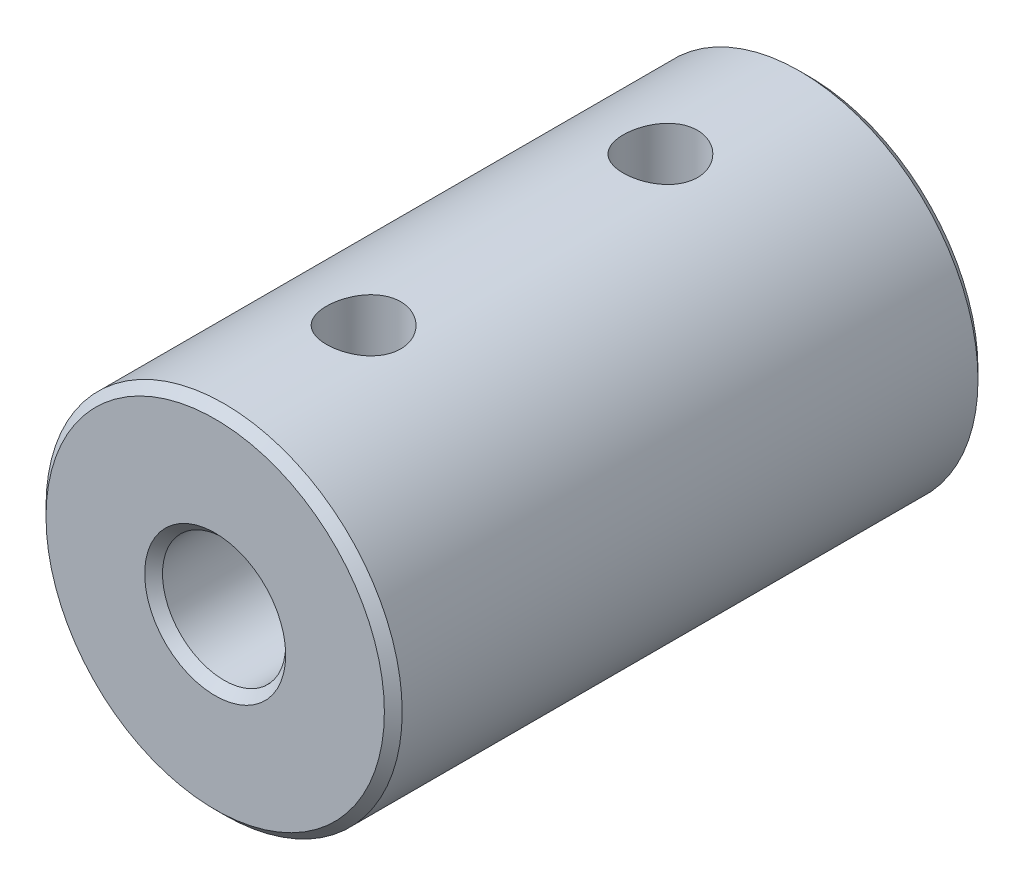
ISO-10303-21;
HEADER;
FILE_DESCRIPTION(('STEP AP214'),'2;1');
FILE_NAME('part.step','',(''),(''),'','','');
FILE_SCHEMA(('AUTOMOTIVE_DESIGN { 1 0 10303 214 1 1 1 1 }'));
ENDSEC;
DATA;
#1=APPLICATION_CONTEXT('core data for automotive mechanical design processes');
#2=APPLICATION_PROTOCOL_DEFINITION('international standard','automotive_design',2000,#1);
#3=PRODUCT_CONTEXT('',#1,'mechanical');
#4=PRODUCT('Part','Part','',(#3));
#5=PRODUCT_RELATED_PRODUCT_CATEGORY('part','',(#4));
#6=PRODUCT_DEFINITION_FORMATION('','',#4);
#7=PRODUCT_DEFINITION_CONTEXT('part definition',#1,'design');
#8=PRODUCT_DEFINITION('design','',#6,#7);
#9=PRODUCT_DEFINITION_SHAPE('','',#8);
#10=(LENGTH_UNIT() NAMED_UNIT(*) SI_UNIT(.MILLI.,.METRE.));
#11=(NAMED_UNIT(*) PLANE_ANGLE_UNIT() SI_UNIT($,.RADIAN.));
#12=(NAMED_UNIT(*) SI_UNIT($,.STERADIAN.) SOLID_ANGLE_UNIT());
#13=UNCERTAINTY_MEASURE_WITH_UNIT(LENGTH_MEASURE(1.E-05),#10,'distance_accuracy_value','');
#14=(GEOMETRIC_REPRESENTATION_CONTEXT(3) GLOBAL_UNCERTAINTY_ASSIGNED_CONTEXT((#13)) GLOBAL_UNIT_ASSIGNED_CONTEXT((#10,
#11,#12)) REPRESENTATION_CONTEXT('',''));
#15=CARTESIAN_POINT('',(0.,0.,0.));
#16=DIRECTION('',(0.,0.,1.));
#17=DIRECTION('',(1.,0.,0.));
#18=AXIS2_PLACEMENT_3D('',#15,#16,#17);
#19=CARTESIAN_POINT('',(0.,0.,10.));
#20=DIRECTION('',(0.,0.,-1.));
#21=DIRECTION('',(-1.,0.,0.));
#22=AXIS2_PLACEMENT_3D('',#19,#20,#21);
#23=CYLINDRICAL_SURFACE('',#22,1.575);
#24=CARTESIAN_POINT('',(0.,0.,-9.7));
#25=DIRECTION('',(0.,0.,1.));
#26=DIRECTION('',(1.,0.,0.));
#27=AXIS2_PLACEMENT_3D('',#24,#25,#26);
#28=CIRCLE('',#27,1.575);
#29=CARTESIAN_POINT('',(1.575,0.,-9.7));
#30=VERTEX_POINT('',#29);
#31=EDGE_CURVE('E45',#30,#30,#28,.F.);
#32=ORIENTED_EDGE('',*,*,#31,.T.);
#33=EDGE_LOOP('',(#32));
#34=FACE_BOUND('',#33,.T.);
#35=CARTESIAN_POINT('',(0.,-1.575,-3.75));
#36=CARTESIAN_POINT('',(0.0601456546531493,-1.57499514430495,-3.75000500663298));
#37=CARTESIAN_POINT('',(0.120366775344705,-1.5715198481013,-3.75437623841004));
#38=CARTESIAN_POINT('',(0.238868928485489,-1.55792894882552,-3.77156843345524));
#39=CARTESIAN_POINT('',(0.297145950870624,-1.54780041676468,-3.78440584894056));
#40=CARTESIAN_POINT('',(0.409732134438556,-1.52186137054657,-3.81761093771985));
#41=CARTESIAN_POINT('',(0.464063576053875,-1.50608633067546,-3.83793161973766));
#42=CARTESIAN_POINT('',(0.568128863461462,-1.46999813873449,-3.88510136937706));
#43=CARTESIAN_POINT('',(0.617862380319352,-1.44968466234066,-3.91195090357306));
#44=CARTESIAN_POINT('',(0.728490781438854,-1.39814810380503,-3.98146362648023));
#45=CARTESIAN_POINT('',(0.787336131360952,-1.36557643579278,-4.02638900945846));
#46=CARTESIAN_POINT('',(0.895456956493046,-1.29726180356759,-4.12477148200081));
#47=CARTESIAN_POINT('',(0.944704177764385,-1.2615099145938,-4.17825294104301));
#48=CARTESIAN_POINT('',(1.03397114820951,-1.18947854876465,-4.29372692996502));
#49=CARTESIAN_POINT('',(1.07383930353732,-1.15319931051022,-4.35583644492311));
#50=CARTESIAN_POINT('',(1.14271101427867,-1.08497066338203,-4.48791754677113));
#51=CARTESIAN_POINT('',(1.17175150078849,-1.05300677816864,-4.5578613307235));
#52=CARTESIAN_POINT('',(1.20774045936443,-1.01114335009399,-4.67462338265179));
#53=CARTESIAN_POINT('',(1.21884620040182,-0.997612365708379,-4.71883754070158));
#54=CARTESIAN_POINT('',(1.23624752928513,-0.975966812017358,-4.80944769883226));
#55=CARTESIAN_POINT('',(1.24255479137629,-0.967839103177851,-4.85583811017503));
#56=CARTESIAN_POINT('',(1.24990556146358,-0.958333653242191,-4.95014787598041));
#57=CARTESIAN_POINT('',(1.25090571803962,-0.957011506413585,-4.99807661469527));
#58=CARTESIAN_POINT('',(1.24741987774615,-0.961547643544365,-5.09340686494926));
#59=CARTESIAN_POINT('',(1.2429287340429,-0.967412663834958,-5.14080783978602));
#60=CARTESIAN_POINT('',(1.22769657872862,-0.986688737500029,-5.24138805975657));
#61=CARTESIAN_POINT('',(1.21603575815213,-1.00119797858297,-5.29420748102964));
#62=CARTESIAN_POINT('',(1.18672132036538,-1.03577487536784,-5.39626952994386));
#63=CARTESIAN_POINT('',(1.16905031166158,-1.05585863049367,-5.44550126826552));
#64=CARTESIAN_POINT('',(1.11882925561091,-1.10938837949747,-5.56256806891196));
#65=CARTESIAN_POINT('',(1.08319226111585,-1.14466968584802,-5.62822918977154));
#66=CARTESIAN_POINT('',(1.00146176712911,-1.21683780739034,-5.75170471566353));
#67=CARTESIAN_POINT('',(0.955353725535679,-1.25372679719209,-5.80950802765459));
#68=CARTESIAN_POINT('',(0.851744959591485,-1.32636945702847,-5.91803274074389));
#69=CARTESIAN_POINT('',(0.794004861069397,-1.36207696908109,-5.96855885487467));
#70=CARTESIAN_POINT('',(0.668220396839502,-1.4279763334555,-6.05922256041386));
#71=CARTESIAN_POINT('',(0.600205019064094,-1.45818319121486,-6.09938854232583));
#72=CARTESIAN_POINT('',(0.476201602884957,-1.50228035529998,-6.1571327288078));
#73=CARTESIAN_POINT('',(0.422465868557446,-1.51836116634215,-6.17788288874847));
#74=CARTESIAN_POINT('',(0.311376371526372,-1.54496636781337,-6.21198647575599));
#75=CARTESIAN_POINT('',(0.254025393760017,-1.55549497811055,-6.22534552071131));
#76=CARTESIAN_POINT('',(0.136906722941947,-1.57015249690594,-6.24389973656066));
#77=CARTESIAN_POINT('',(0.0771287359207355,-1.574250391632,-6.24905534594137));
#78=CARTESIAN_POINT('',(-0.0426225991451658,-1.57556060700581,-6.25070650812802));
#79=CARTESIAN_POINT('',(-0.102595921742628,-1.5727737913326,-6.24720314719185));
#80=CARTESIAN_POINT('',(-0.216301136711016,-1.56104549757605,-6.2323781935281));
#81=CARTESIAN_POINT('',(-0.270164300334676,-1.55258006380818,-6.22166111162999));
#82=CARTESIAN_POINT('',(-0.375066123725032,-1.53062893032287,-6.19363963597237));
#83=CARTESIAN_POINT('',(-0.426103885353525,-1.51714164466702,-6.17633316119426));
#84=CARTESIAN_POINT('',(-0.52783194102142,-1.48494417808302,-6.134515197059));
#85=CARTESIAN_POINT('',(-0.57825623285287,-1.46593826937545,-6.10958958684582));
#86=CARTESIAN_POINT('',(-0.674208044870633,-1.42436158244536,-6.05404930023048));
#87=CARTESIAN_POINT('',(-0.71973548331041,-1.40179074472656,-6.0234345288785));
#88=CARTESIAN_POINT('',(-0.813864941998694,-1.34969205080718,-5.95094591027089));
#89=CARTESIAN_POINT('',(-0.861388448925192,-1.31965937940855,-5.90803858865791));
#90=CARTESIAN_POINT('',(-0.949098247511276,-1.25806014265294,-5.81595039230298));
#91=CARTESIAN_POINT('',(-0.989260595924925,-1.22648898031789,-5.76674989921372));
#92=CARTESIAN_POINT('',(-1.04746730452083,-1.1765504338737,-5.68320914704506));
#93=CARTESIAN_POINT('',(-1.0679641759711,-1.15791508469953,-5.65071980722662));
#94=CARTESIAN_POINT('',(-1.10607386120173,-1.1215713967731,-5.58360536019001));
#95=CARTESIAN_POINT('',(-1.123685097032,-1.10386356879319,-5.54897909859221));
#96=CARTESIAN_POINT('',(-1.17180750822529,-1.05338454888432,-5.44208216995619));
#97=CARTESIAN_POINT('',(-1.1978940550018,-1.02299673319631,-5.36638907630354));
#98=CARTESIAN_POINT('',(-1.22671402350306,-0.987958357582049,-5.24411714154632));
#99=CARTESIAN_POINT('',(-1.23466728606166,-0.977907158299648,-5.20031014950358));
#100=CARTESIAN_POINT('',(-1.2458487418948,-0.963623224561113,-5.11120273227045));
#101=CARTESIAN_POINT('',(-1.24908766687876,-0.959377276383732,-5.06590593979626));
#102=CARTESIAN_POINT('',(-1.25057883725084,-0.957434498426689,-4.9749277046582));
#103=CARTESIAN_POINT('',(-1.24881395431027,-0.959760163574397,-4.92924547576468));
#104=CARTESIAN_POINT('',(-1.2404250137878,-0.970573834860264,-4.83904482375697));
#105=CARTESIAN_POINT('',(-1.23379250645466,-0.979072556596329,-4.79452856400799));
#106=CARTESIAN_POINT('',(-1.21320312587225,-1.00454306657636,-4.69319057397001));
#107=CARTESIAN_POINT('',(-1.19754370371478,-1.02339301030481,-4.6372015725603));
#108=CARTESIAN_POINT('',(-1.15953323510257,-1.06626923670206,-4.52961873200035));
#109=CARTESIAN_POINT('',(-1.13716134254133,-1.09031157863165,-4.47803923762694));
#110=CARTESIAN_POINT('',(-1.07612433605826,-1.15113253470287,-4.35925880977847));
#111=CARTESIAN_POINT('',(-1.03452963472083,-1.18912720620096,-4.29418603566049));
#112=CARTESIAN_POINT('',(-0.940208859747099,-1.26503413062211,-4.1727099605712));
#113=CARTESIAN_POINT('',(-0.887486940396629,-1.30294640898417,-4.11630343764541));
#114=CARTESIAN_POINT('',(-0.780749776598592,-1.36905889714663,-4.02166704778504));
#115=CARTESIAN_POINT('',(-0.728390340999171,-1.39782837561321,-3.98197387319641));
#116=CARTESIAN_POINT('',(-0.61638829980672,-1.45069237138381,-3.91052275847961));
#117=CARTESIAN_POINT('',(-0.556755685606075,-1.47479318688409,-3.87875411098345));
#118=CARTESIAN_POINT('',(-0.442026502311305,-1.51269115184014,-3.82939671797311));
#119=CARTESIAN_POINT('',(-0.387928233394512,-1.52754931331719,-3.81030599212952));
#120=CARTESIAN_POINT('',(-0.276494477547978,-1.55158084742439,-3.77960219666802));
#121=CARTESIAN_POINT('',(-0.219166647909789,-1.5607670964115,-3.76797218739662));
#122=CARTESIAN_POINT('',(-0.134434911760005,-1.56948170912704,-3.75695886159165));
#123=CARTESIAN_POINT('',(-0.107663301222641,-1.57154596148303,-3.75435443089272));
#124=CARTESIAN_POINT('',(-0.0539328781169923,-1.57430633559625,-3.75087370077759));
#125=CARTESIAN_POINT('',(-0.0269740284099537,-1.57500217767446,-3.74999775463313));
#126=CARTESIAN_POINT('',(0.,-1.575,-3.75));
#127=B_SPLINE_CURVE_WITH_KNOTS('',3,(#35,#36,#37,#38,#39,#40,#41,#42,#43,#44,#45,#46,#47,#48,
#49,#50,#51,#52,#53,#54,#55,#56,#57,#58,#59,#60,#61,#62,#63,#64,#65,#66,#67,#68,#69,#70,#71,#72,
#73,#74,#75,#76,#77,#78,#79,#80,#81,#82,#83,#84,#85,#86,#87,#88,#89,#90,#91,#92,#93,#94,#95,#96,
#97,#98,#99,#100,#101,#102,#103,#104,#105,#106,#107,#108,#109,#110,#111,#112,#113,#114,#115,
#116,#117,#118,#119,#120,#121,#122,#123,#124,#125,#126),.UNSPECIFIED.,.T.,.F.,(4,2,2,2,2,2,2,2,
2,2,2,2,2,2,2,2,2,2,2,2,2,2,2,2,2,2,2,2,2,2,2,2,2,2,2,2,2,2,2,2,2,2,2,2,2,4),(0.,
0.180320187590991,0.360991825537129,0.540547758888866,0.720116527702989,0.961486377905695,
1.20355635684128,1.44930485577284,1.69420731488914,1.8363970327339,1.97823970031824,
2.12123925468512,2.2643729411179,2.43145017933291,2.59901505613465,2.84559032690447,
3.09251015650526,3.34515535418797,3.59710067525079,3.77579715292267,3.95435761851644,
4.13377661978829,4.31317311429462,4.47914847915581,4.64517630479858,4.8226383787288,
5.00010341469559,5.21152459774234,5.42362170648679,5.55155139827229,5.6795508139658,
5.93388886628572,6.07031033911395,6.20642077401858,6.34299768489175,6.4798122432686,
6.66213936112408,6.84503867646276,7.10197385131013,7.35881326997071,7.5731773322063,
7.78725016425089,7.96431112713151,8.1409686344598,8.22182182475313,8.3026915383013),.UNSPECIFIED.);
#128=CARTESIAN_POINT('',(0.,-1.575,-3.75));
#129=VERTEX_POINT('',#128);
#130=EDGE_CURVE('E97',#129,#129,#127,.T.);
#131=ORIENTED_EDGE('',*,*,#130,.F.);
#132=EDGE_LOOP('',(#131));
#133=FACE_BOUND('',#132,.T.);
#134=CARTESIAN_POINT('',(0.,1.575,-3.75));
#135=CARTESIAN_POINT('',(-0.0601456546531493,1.57499514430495,-3.75000500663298));
#136=CARTESIAN_POINT('',(-0.120366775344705,1.5715198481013,-3.75437623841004));
#137=CARTESIAN_POINT('',(-0.238868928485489,1.55792894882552,-3.77156843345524));
#138=CARTESIAN_POINT('',(-0.297145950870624,1.54780041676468,-3.78440584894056));
#139=CARTESIAN_POINT('',(-0.409732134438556,1.52186137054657,-3.81761093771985));
#140=CARTESIAN_POINT('',(-0.464063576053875,1.50608633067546,-3.83793161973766));
#141=CARTESIAN_POINT('',(-0.568128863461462,1.46999813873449,-3.88510136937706));
#142=CARTESIAN_POINT('',(-0.617862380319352,1.44968466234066,-3.91195090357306));
#143=CARTESIAN_POINT('',(-0.728490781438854,1.39814810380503,-3.98146362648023));
#144=CARTESIAN_POINT('',(-0.787336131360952,1.36557643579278,-4.02638900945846));
#145=CARTESIAN_POINT('',(-0.895456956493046,1.29726180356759,-4.12477148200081));
#146=CARTESIAN_POINT('',(-0.944704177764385,1.2615099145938,-4.17825294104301));
#147=CARTESIAN_POINT('',(-1.03397114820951,1.18947854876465,-4.29372692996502));
#148=CARTESIAN_POINT('',(-1.07383930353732,1.15319931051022,-4.35583644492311));
#149=CARTESIAN_POINT('',(-1.14271101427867,1.08497066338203,-4.48791754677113));
#150=CARTESIAN_POINT('',(-1.17175150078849,1.05300677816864,-4.5578613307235));
#151=CARTESIAN_POINT('',(-1.20774045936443,1.01114335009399,-4.67462338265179));
#152=CARTESIAN_POINT('',(-1.21884620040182,0.997612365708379,-4.71883754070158));
#153=CARTESIAN_POINT('',(-1.23624752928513,0.975966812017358,-4.80944769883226));
#154=CARTESIAN_POINT('',(-1.24255479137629,0.967839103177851,-4.85583811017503));
#155=CARTESIAN_POINT('',(-1.24990556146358,0.958333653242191,-4.95014787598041));
#156=CARTESIAN_POINT('',(-1.25090571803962,0.957011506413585,-4.99807661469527));
#157=CARTESIAN_POINT('',(-1.24741987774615,0.961547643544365,-5.09340686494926));
#158=CARTESIAN_POINT('',(-1.2429287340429,0.967412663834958,-5.14080783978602));
#159=CARTESIAN_POINT('',(-1.22769657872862,0.986688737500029,-5.24138805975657));
#160=CARTESIAN_POINT('',(-1.21603575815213,1.00119797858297,-5.29420748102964));
#161=CARTESIAN_POINT('',(-1.18672132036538,1.03577487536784,-5.39626952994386));
#162=CARTESIAN_POINT('',(-1.16905031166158,1.05585863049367,-5.44550126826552));
#163=CARTESIAN_POINT('',(-1.11882925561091,1.10938837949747,-5.56256806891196));
#164=CARTESIAN_POINT('',(-1.08319226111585,1.14466968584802,-5.62822918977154));
#165=CARTESIAN_POINT('',(-1.00146176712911,1.21683780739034,-5.75170471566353));
#166=CARTESIAN_POINT('',(-0.955353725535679,1.25372679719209,-5.80950802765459));
#167=CARTESIAN_POINT('',(-0.851744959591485,1.32636945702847,-5.91803274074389));
#168=CARTESIAN_POINT('',(-0.794004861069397,1.36207696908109,-5.96855885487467));
#169=CARTESIAN_POINT('',(-0.668220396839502,1.4279763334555,-6.05922256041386));
#170=CARTESIAN_POINT('',(-0.600205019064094,1.45818319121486,-6.09938854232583));
#171=CARTESIAN_POINT('',(-0.476201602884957,1.50228035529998,-6.1571327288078));
#172=CARTESIAN_POINT('',(-0.422465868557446,1.51836116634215,-6.17788288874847));
#173=CARTESIAN_POINT('',(-0.311376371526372,1.54496636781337,-6.21198647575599));
#174=CARTESIAN_POINT('',(-0.254025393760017,1.55549497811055,-6.22534552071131));
#175=CARTESIAN_POINT('',(-0.136906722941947,1.57015249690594,-6.24389973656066));
#176=CARTESIAN_POINT('',(-0.0771287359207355,1.574250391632,-6.24905534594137));
#177=CARTESIAN_POINT('',(0.0426225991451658,1.57556060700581,-6.25070650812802));
#178=CARTESIAN_POINT('',(0.102595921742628,1.5727737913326,-6.24720314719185));
#179=CARTESIAN_POINT('',(0.216301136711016,1.56104549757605,-6.2323781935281));
#180=CARTESIAN_POINT('',(0.270164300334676,1.55258006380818,-6.22166111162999));
#181=CARTESIAN_POINT('',(0.375066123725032,1.53062893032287,-6.19363963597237));
#182=CARTESIAN_POINT('',(0.426103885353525,1.51714164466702,-6.17633316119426));
#183=CARTESIAN_POINT('',(0.52783194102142,1.48494417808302,-6.134515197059));
#184=CARTESIAN_POINT('',(0.57825623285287,1.46593826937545,-6.10958958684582));
#185=CARTESIAN_POINT('',(0.674208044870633,1.42436158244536,-6.05404930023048));
#186=CARTESIAN_POINT('',(0.71973548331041,1.40179074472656,-6.0234345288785));
#187=CARTESIAN_POINT('',(0.813864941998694,1.34969205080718,-5.95094591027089));
#188=CARTESIAN_POINT('',(0.861388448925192,1.31965937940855,-5.90803858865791));
#189=CARTESIAN_POINT('',(0.949098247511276,1.25806014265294,-5.81595039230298));
#190=CARTESIAN_POINT('',(0.989260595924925,1.22648898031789,-5.76674989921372));
#191=CARTESIAN_POINT('',(1.04746730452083,1.1765504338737,-5.68320914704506));
#192=CARTESIAN_POINT('',(1.0679641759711,1.15791508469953,-5.65071980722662));
#193=CARTESIAN_POINT('',(1.10607386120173,1.1215713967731,-5.58360536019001));
#194=CARTESIAN_POINT('',(1.123685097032,1.10386356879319,-5.54897909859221));
#195=CARTESIAN_POINT('',(1.17180750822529,1.05338454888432,-5.44208216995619));
#196=CARTESIAN_POINT('',(1.1978940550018,1.02299673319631,-5.36638907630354));
#197=CARTESIAN_POINT('',(1.22671402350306,0.987958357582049,-5.24411714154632));
#198=CARTESIAN_POINT('',(1.23466728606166,0.977907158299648,-5.20031014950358));
#199=CARTESIAN_POINT('',(1.2458487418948,0.963623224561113,-5.11120273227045));
#200=CARTESIAN_POINT('',(1.24908766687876,0.959377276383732,-5.06590593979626));
#201=CARTESIAN_POINT('',(1.25057883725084,0.957434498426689,-4.9749277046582));
#202=CARTESIAN_POINT('',(1.24881395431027,0.959760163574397,-4.92924547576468));
#203=CARTESIAN_POINT('',(1.2404250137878,0.970573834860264,-4.83904482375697));
#204=CARTESIAN_POINT('',(1.23379250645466,0.979072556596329,-4.79452856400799));
#205=CARTESIAN_POINT('',(1.21320312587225,1.00454306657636,-4.69319057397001));
#206=CARTESIAN_POINT('',(1.19754370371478,1.02339301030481,-4.6372015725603));
#207=CARTESIAN_POINT('',(1.15953323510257,1.06626923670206,-4.52961873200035));
#208=CARTESIAN_POINT('',(1.13716134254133,1.09031157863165,-4.47803923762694));
#209=CARTESIAN_POINT('',(1.07612433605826,1.15113253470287,-4.35925880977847));
#210=CARTESIAN_POINT('',(1.03452963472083,1.18912720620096,-4.29418603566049));
#211=CARTESIAN_POINT('',(0.940208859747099,1.26503413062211,-4.1727099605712));
#212=CARTESIAN_POINT('',(0.887486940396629,1.30294640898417,-4.11630343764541));
#213=CARTESIAN_POINT('',(0.780749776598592,1.36905889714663,-4.02166704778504));
#214=CARTESIAN_POINT('',(0.728390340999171,1.39782837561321,-3.98197387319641));
#215=CARTESIAN_POINT('',(0.61638829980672,1.45069237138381,-3.91052275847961));
#216=CARTESIAN_POINT('',(0.556755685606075,1.47479318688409,-3.87875411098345));
#217=CARTESIAN_POINT('',(0.442026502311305,1.51269115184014,-3.82939671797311));
#218=CARTESIAN_POINT('',(0.387928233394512,1.52754931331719,-3.81030599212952));
#219=CARTESIAN_POINT('',(0.276494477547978,1.55158084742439,-3.77960219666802));
#220=CARTESIAN_POINT('',(0.219166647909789,1.5607670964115,-3.76797218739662));
#221=CARTESIAN_POINT('',(0.134434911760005,1.56948170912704,-3.75695886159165));
#222=CARTESIAN_POINT('',(0.107663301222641,1.57154596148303,-3.75435443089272));
#223=CARTESIAN_POINT('',(0.0539328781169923,1.57430633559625,-3.75087370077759));
#224=CARTESIAN_POINT('',(0.0269740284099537,1.57500217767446,-3.74999775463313));
#225=CARTESIAN_POINT('',(0.,1.575,-3.75));
#226=B_SPLINE_CURVE_WITH_KNOTS('',3,(#134,#135,#136,#137,#138,#139,#140,#141,#142,#143,#144,
#145,#146,#147,#148,#149,#150,#151,#152,#153,#154,#155,#156,#157,#158,#159,#160,#161,#162,#163,
#164,#165,#166,#167,#168,#169,#170,#171,#172,#173,#174,#175,#176,#177,#178,#179,#180,#181,#182,
#183,#184,#185,#186,#187,#188,#189,#190,#191,#192,#193,#194,#195,#196,#197,#198,#199,#200,#201,
#202,#203,#204,#205,#206,#207,#208,#209,#210,#211,#212,#213,#214,#215,#216,#217,#218,#219,#220,
#221,#222,#223,#224,#225),.UNSPECIFIED.,.T.,.F.,(4,2,2,2,2,2,2,2,2,2,2,2,2,2,2,2,2,2,2,2,2,2,2,
2,2,2,2,2,2,2,2,2,2,2,2,2,2,2,2,2,2,2,2,2,2,4),(0.,0.180320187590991,0.360991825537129,
0.540547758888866,0.720116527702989,0.961486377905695,1.20355635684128,1.44930485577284,
1.69420731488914,1.8363970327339,1.97823970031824,2.12123925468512,2.2643729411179,
2.43145017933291,2.59901505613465,2.84559032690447,3.09251015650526,3.34515535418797,
3.59710067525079,3.77579715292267,3.95435761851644,4.13377661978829,4.31317311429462,
4.47914847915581,4.64517630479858,4.8226383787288,5.00010341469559,5.21152459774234,
5.42362170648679,5.55155139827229,5.6795508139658,5.93388886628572,6.07031033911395,
6.20642077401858,6.34299768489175,6.4798122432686,6.66213936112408,6.84503867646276,
7.10197385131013,7.35881326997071,7.5731773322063,7.78725016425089,7.96431112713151,
8.1409686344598,8.22182182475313,8.3026915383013),.UNSPECIFIED.);
#227=CARTESIAN_POINT('',(0.,1.575,-3.75));
#228=VERTEX_POINT('',#227);
#229=EDGE_CURVE('E92',#228,#228,#226,.T.);
#230=ORIENTED_EDGE('',*,*,#229,.F.);
#231=EDGE_LOOP('',(#230));
#232=FACE_BOUND('',#231,.T.);
#233=CARTESIAN_POINT('',(0.,0.,0.));
#234=DIRECTION('',(0.,0.,1.));
#235=DIRECTION('',(1.,0.,0.));
#236=AXIS2_PLACEMENT_3D('',#233,#234,#235);
#237=CIRCLE('',#236,1.575);
#238=CARTESIAN_POINT('',(1.575,0.,0.));
#239=VERTEX_POINT('',#238);
#240=EDGE_CURVE('E142',#239,#239,#237,.T.);
#241=ORIENTED_EDGE('',*,*,#240,.T.);
#242=EDGE_LOOP('',(#241));
#243=FACE_BOUND('',#242,.T.);
#244=ADVANCED_FACE('F30',(#34,#133,#232,#243),#23,.F.);
#245=CARTESIAN_POINT('',(0.,0.,10.));
#246=DIRECTION('',(0.,0.,1.));
#247=DIRECTION('',(1.,0.,0.));
#248=AXIS2_PLACEMENT_3D('',#245,#246,#247);
#249=PLANE('',#248);
#250=CARTESIAN_POINT('',(0.,0.,10.));
#251=DIRECTION('',(0.,0.,1.));
#252=DIRECTION('',(1.,0.,0.));
#253=AXIS2_PLACEMENT_3D('',#250,#251,#252);
#254=CIRCLE('',#253,2.375);
#255=CARTESIAN_POINT('',(2.375,0.,10.));
#256=VERTEX_POINT('',#255);
#257=EDGE_CURVE('E10',#256,#256,#254,.F.);
#258=ORIENTED_EDGE('',*,*,#257,.T.);
#259=EDGE_LOOP('',(#258));
#260=FACE_BOUND('',#259,.T.);
#261=CARTESIAN_POINT('',(0.,0.,10.));
#262=DIRECTION('',(0.,0.,1.));
#263=DIRECTION('',(1.,0.,0.));
#264=AXIS2_PLACEMENT_3D('',#261,#262,#263);
#265=CIRCLE('',#264,5.7);
#266=CARTESIAN_POINT('',(-5.7,0.,10.));
#267=VERTEX_POINT('',#266);
#268=EDGE_CURVE('E37',#267,#267,#265,.T.);
#269=ORIENTED_EDGE('',*,*,#268,.T.);
#270=EDGE_LOOP('',(#269));
#271=FACE_BOUND('',#270,.T.);
#272=ADVANCED_FACE('F105',(#260,#271),#249,.T.);
#273=CARTESIAN_POINT('',(0.,0.,-10.));
#274=DIRECTION('',(0.,0.,1.));
#275=DIRECTION('',(1.,0.,0.));
#276=AXIS2_PLACEMENT_3D('',#273,#274,#275);
#277=PLANE('',#276);
#278=CARTESIAN_POINT('',(0.,0.,-10.));
#279=DIRECTION('',(0.,0.,1.));
#280=DIRECTION('',(1.,0.,0.));
#281=AXIS2_PLACEMENT_3D('',#278,#279,#280);
#282=CIRCLE('',#281,5.7);
#283=CARTESIAN_POINT('',(5.7,0.,-10.));
#284=VERTEX_POINT('',#283);
#285=EDGE_CURVE('E50',#284,#284,#282,.F.);
#286=ORIENTED_EDGE('',*,*,#285,.T.);
#287=EDGE_LOOP('',(#286));
#288=FACE_BOUND('',#287,.T.);
#289=CARTESIAN_POINT('',(0.,0.,-10.));
#290=DIRECTION('',(0.,0.,1.));
#291=DIRECTION('',(1.,0.,0.));
#292=AXIS2_PLACEMENT_3D('',#289,#290,#291);
#293=CIRCLE('',#292,1.875);
#294=CARTESIAN_POINT('',(1.875,0.,-10.));
#295=VERTEX_POINT('',#294);
#296=EDGE_CURVE('E53',#295,#295,#293,.T.);
#297=ORIENTED_EDGE('',*,*,#296,.T.);
#298=EDGE_LOOP('',(#297));
#299=FACE_BOUND('',#298,.T.);
#300=ADVANCED_FACE('F111',(#288,#299),#277,.F.);
#301=CARTESIAN_POINT('',(0.,0.,10.));
#302=DIRECTION('',(0.,0.,-1.));
#303=DIRECTION('',(-1.,0.,0.));
#304=AXIS2_PLACEMENT_3D('',#301,#302,#303);
#305=CYLINDRICAL_SURFACE('',#304,6.);
#306=CARTESIAN_POINT('',(0.,0.,-9.7));
#307=DIRECTION('',(0.,0.,1.));
#308=DIRECTION('',(1.,0.,0.));
#309=AXIS2_PLACEMENT_3D('',#306,#307,#308);
#310=CIRCLE('',#309,6.);
#311=CARTESIAN_POINT('',(6.,0.,-9.7));
#312=VERTEX_POINT('',#311);
#313=EDGE_CURVE('E56',#312,#312,#310,.T.);
#314=ORIENTED_EDGE('',*,*,#313,.T.);
#315=EDGE_LOOP('',(#314));
#316=FACE_BOUND('',#315,.T.);
#317=CARTESIAN_POINT('',(0.,0.,9.7));
#318=DIRECTION('',(0.,0.,1.));
#319=DIRECTION('',(1.,0.,0.));
#320=AXIS2_PLACEMENT_3D('',#317,#318,#319);
#321=CIRCLE('',#320,6.);
#322=CARTESIAN_POINT('',(-6.,0.,9.7));
#323=VERTEX_POINT('',#322);
#324=EDGE_CURVE('E59',#323,#323,#321,.F.);
#325=ORIENTED_EDGE('',*,*,#324,.T.);
#326=EDGE_LOOP('',(#325));
#327=FACE_BOUND('',#326,.T.);
#328=CARTESIAN_POINT('',(0.,-6.,-3.75));
#329=CARTESIAN_POINT('',(0.0694090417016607,-5.99999871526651,-3.75000247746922));
#330=CARTESIAN_POINT('',(0.138848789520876,-5.99878328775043,-3.75580066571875));
#331=CARTESIAN_POINT('',(0.275761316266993,-5.9940520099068,-3.77881934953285));
#332=CARTESIAN_POINT('',(0.343232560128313,-5.99053441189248,-3.79604852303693));
#333=CARTESIAN_POINT('',(0.474209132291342,-5.98159109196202,-3.84137045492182));
#334=CARTESIAN_POINT('',(0.537718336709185,-5.97616727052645,-3.86945239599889));
#335=CARTESIAN_POINT('',(0.659120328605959,-5.96399927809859,-3.93564960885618));
#336=CARTESIAN_POINT('',(0.717013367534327,-5.95725516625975,-3.97376443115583));
#337=CARTESIAN_POINT('',(0.826390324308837,-5.9430770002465,-4.05953634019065));
#338=CARTESIAN_POINT('',(0.877780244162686,-5.93563505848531,-4.10731200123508));
#339=CARTESIAN_POINT('',(0.971877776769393,-5.92095657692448,-4.21079465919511));
#340=CARTESIAN_POINT('',(1.01458467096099,-5.91372005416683,-4.26650231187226));
#341=CARTESIAN_POINT('',(1.09051031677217,-5.90019442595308,-4.38495196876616));
#342=CARTESIAN_POINT('',(1.12363054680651,-5.89391545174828,-4.44775838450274));
#343=CARTESIAN_POINT('',(1.17881119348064,-5.8831284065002,-4.57819745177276));
#344=CARTESIAN_POINT('',(1.20087280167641,-5.87862014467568,-4.64582958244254));
#345=CARTESIAN_POINT('',(1.23300240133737,-5.87196500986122,-4.78298523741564));
#346=CARTESIAN_POINT('',(1.24323597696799,-5.86978556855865,-4.85246835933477));
#347=CARTESIAN_POINT('',(1.25193357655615,-5.86793690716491,-4.99219684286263));
#348=CARTESIAN_POINT('',(1.25039890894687,-5.86826740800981,-5.0624421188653));
#349=CARTESIAN_POINT('',(1.23573719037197,-5.87137174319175,-5.20048102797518));
#350=CARTESIAN_POINT('',(1.2228010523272,-5.87410533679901,-5.26829597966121));
#351=CARTESIAN_POINT('',(1.18600543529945,-5.88164437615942,-5.40077150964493));
#352=CARTESIAN_POINT('',(1.16214539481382,-5.88644992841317,-5.46543192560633));
#353=CARTESIAN_POINT('',(1.10400003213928,-5.89763191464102,-5.59030722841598));
#354=CARTESIAN_POINT('',(1.06964002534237,-5.90401953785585,-5.65048629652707));
#355=CARTESIAN_POINT('',(0.991522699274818,-5.91763890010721,-5.76429574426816));
#356=CARTESIAN_POINT('',(0.947764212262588,-5.92487074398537,-5.81792530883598));
#357=CARTESIAN_POINT('',(0.851074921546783,-5.93953730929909,-5.91821396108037));
#358=CARTESIAN_POINT('',(0.797981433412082,-5.94697323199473,-5.96471616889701));
#359=CARTESIAN_POINT('',(0.684667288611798,-5.96108088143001,-6.04818044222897));
#360=CARTESIAN_POINT('',(0.624446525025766,-5.96775259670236,-6.0851423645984));
#361=CARTESIAN_POINT('',(0.498405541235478,-5.97959870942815,-6.14851008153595));
#362=CARTESIAN_POINT('',(0.4325754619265,-5.98477039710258,-6.17489680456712));
#363=CARTESIAN_POINT('',(0.297284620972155,-5.99301338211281,-6.21619170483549));
#364=CARTESIAN_POINT('',(0.227824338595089,-5.99608495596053,-6.2311013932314));
#365=CARTESIAN_POINT('',(0.0885918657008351,-5.99974275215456,-6.24879425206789));
#366=CARTESIAN_POINT('',(0.0188480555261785,-6.00037293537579,-6.25179194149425));
#367=CARTESIAN_POINT('',(-0.120143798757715,-5.99919952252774,-6.2461550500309));
#368=CARTESIAN_POINT('',(-0.189391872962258,-5.99739607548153,-6.2375211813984));
#369=CARTESIAN_POINT('',(-0.324726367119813,-5.99158564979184,-6.20904434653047));
#370=CARTESIAN_POINT('',(-0.390837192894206,-5.98760052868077,-6.18931251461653));
#371=CARTESIAN_POINT('',(-0.518811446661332,-5.97787227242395,-6.13932213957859));
#372=CARTESIAN_POINT('',(-0.580674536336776,-5.97212899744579,-6.10906275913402));
#373=CARTESIAN_POINT('',(-0.699294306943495,-5.95941241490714,-6.03841962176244));
#374=CARTESIAN_POINT('',(-0.755973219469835,-5.9524239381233,-5.99790807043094));
#375=CARTESIAN_POINT('',(-0.861805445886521,-5.93802568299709,-5.90808043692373));
#376=CARTESIAN_POINT('',(-0.910957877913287,-5.93061585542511,-5.85876332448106));
#377=CARTESIAN_POINT('',(-1.0011786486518,-5.91606024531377,-5.7517444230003));
#378=CARTESIAN_POINT('',(-1.04209914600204,-5.90892089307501,-5.69391696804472));
#379=CARTESIAN_POINT('',(-1.11364719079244,-5.89585601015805,-5.57208371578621));
#380=CARTESIAN_POINT('',(-1.14427516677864,-5.88993042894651,-5.50807817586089));
#381=CARTESIAN_POINT('',(-1.19417246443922,-5.88001700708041,-5.37603880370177));
#382=CARTESIAN_POINT('',(-1.21350309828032,-5.87601872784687,-5.30802896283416));
#383=CARTESIAN_POINT('',(-1.24044038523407,-5.87039184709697,-5.16963344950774));
#384=CARTESIAN_POINT('',(-1.24804871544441,-5.86876290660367,-5.09924811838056));
#385=CARTESIAN_POINT('',(-1.25125926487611,-5.86807907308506,-4.95958659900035));
#386=CARTESIAN_POINT('',(-1.24709542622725,-5.86897402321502,-4.89031592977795));
#387=CARTESIAN_POINT('',(-1.22739905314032,-5.87312447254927,-4.75348599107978));
#388=CARTESIAN_POINT('',(-1.21186662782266,-5.87637994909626,-4.68592670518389));
#389=CARTESIAN_POINT('',(-1.16998217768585,-5.88486132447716,-4.55460222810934));
#390=CARTESIAN_POINT('',(-1.14366117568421,-5.8900815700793,-4.49082675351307));
#391=CARTESIAN_POINT('',(-1.08097457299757,-5.90190705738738,-4.36856122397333));
#392=CARTESIAN_POINT('',(-1.0446080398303,-5.9085124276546,-4.31007166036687));
#393=CARTESIAN_POINT('',(-0.962073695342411,-5.92251579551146,-4.19887837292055));
#394=CARTESIAN_POINT('',(-0.915737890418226,-5.92992613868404,-4.14630087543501));
#395=CARTESIAN_POINT('',(-0.814924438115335,-5.94461839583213,-4.04959050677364));
#396=CARTESIAN_POINT('',(-0.760444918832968,-5.9519002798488,-4.00545958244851));
#397=CARTESIAN_POINT('',(-0.644134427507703,-5.96561444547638,-3.92641142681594));
#398=CARTESIAN_POINT('',(-0.582225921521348,-5.97203596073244,-3.89160632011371));
#399=CARTESIAN_POINT('',(-0.453319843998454,-5.98319908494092,-3.83294977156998));
#400=CARTESIAN_POINT('',(-0.386326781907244,-5.98794216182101,-3.80908875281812));
#401=CARTESIAN_POINT('',(-0.266015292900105,-5.99432499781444,-3.77745972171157));
#402=CARTESIAN_POINT('',(-0.213367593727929,-5.99644035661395,-3.76718123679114));
#403=CARTESIAN_POINT('',(-0.107152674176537,-5.99927832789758,-3.75345054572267));
#404=CARTESIAN_POINT('',(-0.0535854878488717,-6.00000099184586,-3.74999808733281));
#405=CARTESIAN_POINT('',(0.,-6.,-3.75));
#406=B_SPLINE_CURVE_WITH_KNOTS('',3,(#328,#329,#330,#331,#332,#333,#334,#335,#336,#337,#338,
#339,#340,#341,#342,#343,#344,#345,#346,#347,#348,#349,#350,#351,#352,#353,#354,#355,#356,#357,
#358,#359,#360,#361,#362,#363,#364,#365,#366,#367,#368,#369,#370,#371,#372,#373,#374,#375,#376,
#377,#378,#379,#380,#381,#382,#383,#384,#385,#386,#387,#388,#389,#390,#391,#392,#393,#394,#395,
#396,#397,#398,#399,#400,#401,#402,#403,#404,#405),.UNSPECIFIED.,.T.,.F.,(4,2,2,2,2,2,2,2,2,2,2,
2,2,2,2,2,2,2,2,2,2,2,2,2,2,2,2,2,2,2,2,2,2,2,2,2,2,2,4),(0.,0.208031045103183,
0.416220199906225,0.624202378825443,0.83217524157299,1.04287526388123,1.25359271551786,
1.46640449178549,1.6791933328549,1.88896575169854,2.09871484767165,2.3050171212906,
2.5113300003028,2.71914592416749,2.92698768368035,3.13889526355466,3.35080602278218,
3.56309724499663,3.77536051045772,3.98378339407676,4.19219351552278,4.39855286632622,
4.60492863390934,4.81401583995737,5.02312752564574,5.23571263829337,5.4482888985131,
5.65970050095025,5.87108185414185,6.07829223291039,6.28550062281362,6.49211731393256,
6.6987531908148,6.9091902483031,7.1196757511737,7.33258864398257,7.54531486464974,
7.70592588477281,7.86653096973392),.UNSPECIFIED.);
#407=CARTESIAN_POINT('',(0.,-6.,-3.75));
#408=VERTEX_POINT('',#407);
#409=EDGE_CURVE('E62',#408,#408,#406,.T.);
#410=ORIENTED_EDGE('',*,*,#409,.T.);
#411=EDGE_LOOP('',(#410));
#412=FACE_BOUND('',#411,.T.);
#413=CARTESIAN_POINT('',(0.,6.,-3.75));
#414=CARTESIAN_POINT('',(-0.0694090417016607,5.99999871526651,-3.75000247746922));
#415=CARTESIAN_POINT('',(-0.138848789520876,5.99878328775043,-3.75580066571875));
#416=CARTESIAN_POINT('',(-0.275761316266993,5.9940520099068,-3.77881934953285));
#417=CARTESIAN_POINT('',(-0.343232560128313,5.99053441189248,-3.79604852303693));
#418=CARTESIAN_POINT('',(-0.474209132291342,5.98159109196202,-3.84137045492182));
#419=CARTESIAN_POINT('',(-0.537718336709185,5.97616727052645,-3.86945239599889));
#420=CARTESIAN_POINT('',(-0.659120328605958,5.96399927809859,-3.93564960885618));
#421=CARTESIAN_POINT('',(-0.717013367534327,5.95725516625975,-3.97376443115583));
#422=CARTESIAN_POINT('',(-0.826390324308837,5.9430770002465,-4.05953634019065));
#423=CARTESIAN_POINT('',(-0.877780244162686,5.93563505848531,-4.10731200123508));
#424=CARTESIAN_POINT('',(-0.971877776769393,5.92095657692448,-4.21079465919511));
#425=CARTESIAN_POINT('',(-1.01458467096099,5.91372005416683,-4.26650231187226));
#426=CARTESIAN_POINT('',(-1.09051031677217,5.90019442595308,-4.38495196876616));
#427=CARTESIAN_POINT('',(-1.12363054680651,5.89391545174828,-4.44775838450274));
#428=CARTESIAN_POINT('',(-1.17881119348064,5.8831284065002,-4.57819745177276));
#429=CARTESIAN_POINT('',(-1.20087280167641,5.87862014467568,-4.64582958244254));
#430=CARTESIAN_POINT('',(-1.23300240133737,5.87196500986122,-4.78298523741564));
#431=CARTESIAN_POINT('',(-1.24323597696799,5.86978556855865,-4.85246835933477));
#432=CARTESIAN_POINT('',(-1.25193357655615,5.86793690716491,-4.99219684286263));
#433=CARTESIAN_POINT('',(-1.25039890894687,5.86826740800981,-5.0624421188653));
#434=CARTESIAN_POINT('',(-1.23573719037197,5.87137174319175,-5.20048102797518));
#435=CARTESIAN_POINT('',(-1.2228010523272,5.87410533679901,-5.26829597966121));
#436=CARTESIAN_POINT('',(-1.18600543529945,5.88164437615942,-5.40077150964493));
#437=CARTESIAN_POINT('',(-1.16214539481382,5.88644992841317,-5.46543192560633));
#438=CARTESIAN_POINT('',(-1.10400003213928,5.89763191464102,-5.59030722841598));
#439=CARTESIAN_POINT('',(-1.06964002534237,5.90401953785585,-5.65048629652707));
#440=CARTESIAN_POINT('',(-0.991522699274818,5.91763890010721,-5.76429574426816));
#441=CARTESIAN_POINT('',(-0.947764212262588,5.92487074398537,-5.81792530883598));
#442=CARTESIAN_POINT('',(-0.851074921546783,5.93953730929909,-5.91821396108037));
#443=CARTESIAN_POINT('',(-0.797981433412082,5.94697323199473,-5.96471616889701));
#444=CARTESIAN_POINT('',(-0.684667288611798,5.96108088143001,-6.04818044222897));
#445=CARTESIAN_POINT('',(-0.624446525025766,5.96775259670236,-6.0851423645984));
#446=CARTESIAN_POINT('',(-0.498405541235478,5.97959870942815,-6.14851008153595));
#447=CARTESIAN_POINT('',(-0.4325754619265,5.98477039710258,-6.17489680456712));
#448=CARTESIAN_POINT('',(-0.297284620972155,5.99301338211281,-6.21619170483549));
#449=CARTESIAN_POINT('',(-0.227824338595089,5.99608495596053,-6.2311013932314));
#450=CARTESIAN_POINT('',(-0.0885918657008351,5.99974275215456,-6.24879425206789));
#451=CARTESIAN_POINT('',(-0.0188480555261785,6.00037293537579,-6.25179194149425));
#452=CARTESIAN_POINT('',(0.120143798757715,5.99919952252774,-6.2461550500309));
#453=CARTESIAN_POINT('',(0.189391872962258,5.99739607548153,-6.2375211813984));
#454=CARTESIAN_POINT('',(0.324726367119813,5.99158564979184,-6.20904434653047));
#455=CARTESIAN_POINT('',(0.390837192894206,5.98760052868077,-6.18931251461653));
#456=CARTESIAN_POINT('',(0.518811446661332,5.97787227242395,-6.13932213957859));
#457=CARTESIAN_POINT('',(0.580674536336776,5.97212899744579,-6.10906275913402));
#458=CARTESIAN_POINT('',(0.699294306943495,5.95941241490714,-6.03841962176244));
#459=CARTESIAN_POINT('',(0.755973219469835,5.9524239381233,-5.99790807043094));
#460=CARTESIAN_POINT('',(0.861805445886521,5.93802568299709,-5.90808043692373));
#461=CARTESIAN_POINT('',(0.910957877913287,5.93061585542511,-5.85876332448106));
#462=CARTESIAN_POINT('',(1.0011786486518,5.91606024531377,-5.7517444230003));
#463=CARTESIAN_POINT('',(1.04209914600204,5.90892089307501,-5.69391696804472));
#464=CARTESIAN_POINT('',(1.11364719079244,5.89585601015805,-5.57208371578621));
#465=CARTESIAN_POINT('',(1.14427516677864,5.88993042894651,-5.50807817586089));
#466=CARTESIAN_POINT('',(1.19417246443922,5.88001700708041,-5.37603880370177));
#467=CARTESIAN_POINT('',(1.21350309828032,5.87601872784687,-5.30802896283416));
#468=CARTESIAN_POINT('',(1.24044038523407,5.87039184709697,-5.16963344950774));
#469=CARTESIAN_POINT('',(1.24804871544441,5.86876290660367,-5.09924811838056));
#470=CARTESIAN_POINT('',(1.25125926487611,5.86807907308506,-4.95958659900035));
#471=CARTESIAN_POINT('',(1.24709542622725,5.86897402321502,-4.89031592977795));
#472=CARTESIAN_POINT('',(1.22739905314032,5.87312447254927,-4.75348599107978));
#473=CARTESIAN_POINT('',(1.21186662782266,5.87637994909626,-4.68592670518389));
#474=CARTESIAN_POINT('',(1.16998217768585,5.88486132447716,-4.55460222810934));
#475=CARTESIAN_POINT('',(1.14366117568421,5.8900815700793,-4.49082675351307));
#476=CARTESIAN_POINT('',(1.08097457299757,5.90190705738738,-4.36856122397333));
#477=CARTESIAN_POINT('',(1.0446080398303,5.9085124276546,-4.31007166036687));
#478=CARTESIAN_POINT('',(0.962073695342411,5.92251579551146,-4.19887837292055));
#479=CARTESIAN_POINT('',(0.915737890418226,5.92992613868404,-4.14630087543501));
#480=CARTESIAN_POINT('',(0.814924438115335,5.94461839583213,-4.04959050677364));
#481=CARTESIAN_POINT('',(0.760444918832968,5.9519002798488,-4.00545958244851));
#482=CARTESIAN_POINT('',(0.644134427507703,5.96561444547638,-3.92641142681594));
#483=CARTESIAN_POINT('',(0.582225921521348,5.97203596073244,-3.89160632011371));
#484=CARTESIAN_POINT('',(0.453319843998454,5.98319908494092,-3.83294977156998));
#485=CARTESIAN_POINT('',(0.386326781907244,5.98794216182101,-3.80908875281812));
#486=CARTESIAN_POINT('',(0.266015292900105,5.99432499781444,-3.77745972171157));
#487=CARTESIAN_POINT('',(0.213367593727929,5.99644035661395,-3.76718123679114));
#488=CARTESIAN_POINT('',(0.107152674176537,5.99927832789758,-3.75345054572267));
#489=CARTESIAN_POINT('',(0.0535854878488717,6.00000099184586,-3.74999808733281));
#490=CARTESIAN_POINT('',(0.,6.,-3.75));
#491=B_SPLINE_CURVE_WITH_KNOTS('',3,(#413,#414,#415,#416,#417,#418,#419,#420,#421,#422,#423,
#424,#425,#426,#427,#428,#429,#430,#431,#432,#433,#434,#435,#436,#437,#438,#439,#440,#441,#442,
#443,#444,#445,#446,#447,#448,#449,#450,#451,#452,#453,#454,#455,#456,#457,#458,#459,#460,#461,
#462,#463,#464,#465,#466,#467,#468,#469,#470,#471,#472,#473,#474,#475,#476,#477,#478,#479,#480,
#481,#482,#483,#484,#485,#486,#487,#488,#489,#490),.UNSPECIFIED.,.T.,.F.,(4,2,2,2,2,2,2,2,2,2,2,
2,2,2,2,2,2,2,2,2,2,2,2,2,2,2,2,2,2,2,2,2,2,2,2,2,2,2,4),(0.,0.208031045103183,
0.416220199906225,0.624202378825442,0.83217524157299,1.04287526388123,1.25359271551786,
1.46640449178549,1.6791933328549,1.88896575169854,2.09871484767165,2.3050171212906,
2.5113300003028,2.71914592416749,2.92698768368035,3.13889526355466,3.35080602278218,
3.56309724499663,3.77536051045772,3.98378339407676,4.19219351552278,4.39855286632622,
4.60492863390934,4.81401583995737,5.02312752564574,5.23571263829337,5.4482888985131,
5.65970050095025,5.87108185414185,6.07829223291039,6.28550062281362,6.49211731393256,
6.6987531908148,6.9091902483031,7.1196757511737,7.33258864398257,7.54531486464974,
7.70592588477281,7.86653096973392),.UNSPECIFIED.);
#492=CARTESIAN_POINT('',(0.,6.,-3.75));
#493=VERTEX_POINT('',#492);
#494=EDGE_CURVE('E69',#493,#493,#491,.T.);
#495=ORIENTED_EDGE('',*,*,#494,.T.);
#496=EDGE_LOOP('',(#495));
#497=FACE_BOUND('',#496,.T.);
#498=CARTESIAN_POINT('',(0.,-6.,6.25));
#499=CARTESIAN_POINT('',(0.0694090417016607,-5.99999871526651,6.24999752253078));
#500=CARTESIAN_POINT('',(0.138848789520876,-5.99878328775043,6.24419933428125));
#501=CARTESIAN_POINT('',(0.275761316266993,-5.9940520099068,6.22118065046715));
#502=CARTESIAN_POINT('',(0.343232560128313,-5.99053441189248,6.20395147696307));
#503=CARTESIAN_POINT('',(0.474209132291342,-5.98159109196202,6.15862954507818));
#504=CARTESIAN_POINT('',(0.537718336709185,-5.97616727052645,6.13054760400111));
#505=CARTESIAN_POINT('',(0.659120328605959,-5.96399927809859,6.06435039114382));
#506=CARTESIAN_POINT('',(0.717013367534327,-5.95725516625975,6.02623556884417));
#507=CARTESIAN_POINT('',(0.826390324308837,-5.9430770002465,5.94046365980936));
#508=CARTESIAN_POINT('',(0.877780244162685,-5.93563505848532,5.89268799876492));
#509=CARTESIAN_POINT('',(0.971877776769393,-5.92095657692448,5.78920534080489));
#510=CARTESIAN_POINT('',(1.01458467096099,-5.91372005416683,5.73349768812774));
#511=CARTESIAN_POINT('',(1.09051031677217,-5.90019442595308,5.61504803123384));
#512=CARTESIAN_POINT('',(1.12363054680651,-5.89391545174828,5.55224161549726));
#513=CARTESIAN_POINT('',(1.17881119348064,-5.8831284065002,5.42180254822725));
#514=CARTESIAN_POINT('',(1.20087280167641,-5.87862014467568,5.35417041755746));
#515=CARTESIAN_POINT('',(1.23300240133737,-5.87196500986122,5.21701476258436));
#516=CARTESIAN_POINT('',(1.24323597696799,-5.86978556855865,5.14753164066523));
#517=CARTESIAN_POINT('',(1.25193357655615,-5.86793690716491,5.00780315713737));
#518=CARTESIAN_POINT('',(1.25039890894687,-5.86826740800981,4.9375578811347));
#519=CARTESIAN_POINT('',(1.23573719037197,-5.87137174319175,4.79951897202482));
#520=CARTESIAN_POINT('',(1.2228010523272,-5.87410533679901,4.73170402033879));
#521=CARTESIAN_POINT('',(1.18600543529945,-5.88164437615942,4.59922849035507));
#522=CARTESIAN_POINT('',(1.16214539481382,-5.88644992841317,4.53456807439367));
#523=CARTESIAN_POINT('',(1.10400003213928,-5.89763191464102,4.40969277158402));
#524=CARTESIAN_POINT('',(1.06964002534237,-5.90401953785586,4.34951370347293));
#525=CARTESIAN_POINT('',(0.991522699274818,-5.91763890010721,4.23570425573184));
#526=CARTESIAN_POINT('',(0.947764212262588,-5.92487074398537,4.18207469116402));
#527=CARTESIAN_POINT('',(0.851074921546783,-5.93953730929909,4.08178603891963));
#528=CARTESIAN_POINT('',(0.797981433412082,-5.94697323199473,4.03528383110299));
#529=CARTESIAN_POINT('',(0.684667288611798,-5.96108088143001,3.95181955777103));
#530=CARTESIAN_POINT('',(0.624446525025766,-5.96775259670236,3.9148576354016));
#531=CARTESIAN_POINT('',(0.498405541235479,-5.97959870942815,3.85148991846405));
#532=CARTESIAN_POINT('',(0.4325754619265,-5.98477039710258,3.82510319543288));
#533=CARTESIAN_POINT('',(0.297284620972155,-5.99301338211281,3.78380829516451));
#534=CARTESIAN_POINT('',(0.22782433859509,-5.99608495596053,3.7688986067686));
#535=CARTESIAN_POINT('',(0.0885918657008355,-5.99974275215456,3.75120574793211));
#536=CARTESIAN_POINT('',(0.0188480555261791,-6.00037293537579,3.74820805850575));
#537=CARTESIAN_POINT('',(-0.120143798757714,-5.99919952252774,3.7538449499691));
#538=CARTESIAN_POINT('',(-0.189391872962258,-5.99739607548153,3.7624788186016));
#539=CARTESIAN_POINT('',(-0.324726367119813,-5.99158564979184,3.79095565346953));
#540=CARTESIAN_POINT('',(-0.390837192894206,-5.98760052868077,3.81068748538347));
#541=CARTESIAN_POINT('',(-0.518811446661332,-5.97787227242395,3.86067786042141));
#542=CARTESIAN_POINT('',(-0.580674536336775,-5.97212899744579,3.89093724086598));
#543=CARTESIAN_POINT('',(-0.699294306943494,-5.95941241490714,3.96158037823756));
#544=CARTESIAN_POINT('',(-0.755973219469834,-5.9524239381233,4.00209192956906));
#545=CARTESIAN_POINT('',(-0.86180544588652,-5.93802568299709,4.09191956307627));
#546=CARTESIAN_POINT('',(-0.910957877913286,-5.93061585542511,4.14123667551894));
#547=CARTESIAN_POINT('',(-1.0011786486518,-5.91606024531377,4.2482555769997));
#548=CARTESIAN_POINT('',(-1.04209914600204,-5.90892089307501,4.30608303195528));
#549=CARTESIAN_POINT('',(-1.11364719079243,-5.89585601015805,4.42791628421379));
#550=CARTESIAN_POINT('',(-1.14427516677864,-5.88993042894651,4.49192182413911));
#551=CARTESIAN_POINT('',(-1.19417246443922,-5.88001700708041,4.62396119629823));
#552=CARTESIAN_POINT('',(-1.21350309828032,-5.87601872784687,4.69197103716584));
#553=CARTESIAN_POINT('',(-1.24044038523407,-5.87039184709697,4.83036655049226));
#554=CARTESIAN_POINT('',(-1.24804871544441,-5.86876290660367,4.90075188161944));
#555=CARTESIAN_POINT('',(-1.25125926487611,-5.86807907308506,5.04041340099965));
#556=CARTESIAN_POINT('',(-1.24709542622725,-5.86897402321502,5.10968407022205));
#557=CARTESIAN_POINT('',(-1.22739905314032,-5.87312447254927,5.24651400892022));
#558=CARTESIAN_POINT('',(-1.21186662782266,-5.87637994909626,5.31407329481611));
#559=CARTESIAN_POINT('',(-1.16998217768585,-5.88486132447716,5.44539777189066));
#560=CARTESIAN_POINT('',(-1.14366117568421,-5.8900815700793,5.50917324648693));
#561=CARTESIAN_POINT('',(-1.08097457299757,-5.90190705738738,5.63143877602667));
#562=CARTESIAN_POINT('',(-1.0446080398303,-5.9085124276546,5.68992833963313));
#563=CARTESIAN_POINT('',(-0.962073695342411,-5.92251579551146,5.80112162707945));
#564=CARTESIAN_POINT('',(-0.915737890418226,-5.92992613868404,5.85369912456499));
#565=CARTESIAN_POINT('',(-0.814924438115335,-5.94461839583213,5.95040949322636));
#566=CARTESIAN_POINT('',(-0.760444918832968,-5.9519002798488,5.99454041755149));
#567=CARTESIAN_POINT('',(-0.644134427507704,-5.96561444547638,6.07358857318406));
#568=CARTESIAN_POINT('',(-0.582225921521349,-5.97203596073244,6.10839367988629));
#569=CARTESIAN_POINT('',(-0.453319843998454,-5.98319908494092,6.16705022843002));
#570=CARTESIAN_POINT('',(-0.386326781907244,-5.98794216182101,6.19091124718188));
#571=CARTESIAN_POINT('',(-0.266015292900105,-5.99432499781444,6.22254027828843));
#572=CARTESIAN_POINT('',(-0.213367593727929,-5.99644035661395,6.23281876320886));
#573=CARTESIAN_POINT('',(-0.107152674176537,-5.99927832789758,6.24654945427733));
#574=CARTESIAN_POINT('',(-0.0535854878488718,-6.00000099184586,6.25000191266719));
#575=CARTESIAN_POINT('',(0.,-6.,6.25));
#576=B_SPLINE_CURVE_WITH_KNOTS('',3,(#498,#499,#500,#501,#502,#503,#504,#505,#506,#507,#508,
#509,#510,#511,#512,#513,#514,#515,#516,#517,#518,#519,#520,#521,#522,#523,#524,#525,#526,#527,
#528,#529,#530,#531,#532,#533,#534,#535,#536,#537,#538,#539,#540,#541,#542,#543,#544,#545,#546,
#547,#548,#549,#550,#551,#552,#553,#554,#555,#556,#557,#558,#559,#560,#561,#562,#563,#564,#565,
#566,#567,#568,#569,#570,#571,#572,#573,#574,#575),.UNSPECIFIED.,.T.,.F.,(4,2,2,2,2,2,2,2,2,2,2,
2,2,2,2,2,2,2,2,2,2,2,2,2,2,2,2,2,2,2,2,2,2,2,2,2,2,2,4),(0.,0.208031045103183,
0.416220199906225,0.624202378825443,0.83217524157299,1.04287526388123,1.25359271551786,
1.46640449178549,1.6791933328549,1.88896575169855,2.09871484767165,2.3050171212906,
2.5113300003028,2.71914592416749,2.92698768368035,3.13889526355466,3.35080602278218,
3.56309724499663,3.77536051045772,3.98378339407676,4.19219351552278,4.39855286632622,
4.60492863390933,4.81401583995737,5.02312752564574,5.23571263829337,5.44828889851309,
5.65970050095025,5.87108185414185,6.07829223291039,6.28550062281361,6.49211731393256,
6.6987531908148,6.90919024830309,7.1196757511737,7.33258864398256,7.54531486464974,
7.7059258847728,7.86653096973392),.UNSPECIFIED.);
#577=CARTESIAN_POINT('',(0.,-6.,6.25));
#578=VERTEX_POINT('',#577);
#579=EDGE_CURVE('E148',#578,#578,#576,.T.);
#580=ORIENTED_EDGE('',*,*,#579,.T.);
#581=EDGE_LOOP('',(#580));
#582=FACE_BOUND('',#581,.T.);
#583=CARTESIAN_POINT('',(0.,6.,6.25));
#584=CARTESIAN_POINT('',(-0.0694090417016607,5.99999871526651,6.24999752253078));
#585=CARTESIAN_POINT('',(-0.138848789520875,5.99878328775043,6.24419933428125));
#586=CARTESIAN_POINT('',(-0.275761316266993,5.9940520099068,6.22118065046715));
#587=CARTESIAN_POINT('',(-0.343232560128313,5.99053441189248,6.20395147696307));
#588=CARTESIAN_POINT('',(-0.474209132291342,5.98159109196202,6.15862954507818));
#589=CARTESIAN_POINT('',(-0.537718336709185,5.97616727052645,6.13054760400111));
#590=CARTESIAN_POINT('',(-0.659120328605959,5.96399927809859,6.06435039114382));
#591=CARTESIAN_POINT('',(-0.717013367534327,5.95725516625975,6.02623556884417));
#592=CARTESIAN_POINT('',(-0.826390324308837,5.9430770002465,5.94046365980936));
#593=CARTESIAN_POINT('',(-0.877780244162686,5.93563505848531,5.89268799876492));
#594=CARTESIAN_POINT('',(-0.971877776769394,5.92095657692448,5.78920534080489));
#595=CARTESIAN_POINT('',(-1.01458467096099,5.91372005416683,5.73349768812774));
#596=CARTESIAN_POINT('',(-1.09051031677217,5.90019442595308,5.61504803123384));
#597=CARTESIAN_POINT('',(-1.12363054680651,5.89391545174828,5.55224161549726));
#598=CARTESIAN_POINT('',(-1.17881119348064,5.8831284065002,5.42180254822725));
#599=CARTESIAN_POINT('',(-1.20087280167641,5.87862014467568,5.35417041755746));
#600=CARTESIAN_POINT('',(-1.23300240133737,5.87196500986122,5.21701476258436));
#601=CARTESIAN_POINT('',(-1.24323597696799,5.86978556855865,5.14753164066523));
#602=CARTESIAN_POINT('',(-1.25193357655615,5.86793690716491,5.00780315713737));
#603=CARTESIAN_POINT('',(-1.25039890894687,5.86826740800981,4.9375578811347));
#604=CARTESIAN_POINT('',(-1.23573719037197,5.87137174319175,4.79951897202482));
#605=CARTESIAN_POINT('',(-1.2228010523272,5.87410533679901,4.73170402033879));
#606=CARTESIAN_POINT('',(-1.18600543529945,5.88164437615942,4.59922849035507));
#607=CARTESIAN_POINT('',(-1.16214539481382,5.88644992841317,4.53456807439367));
#608=CARTESIAN_POINT('',(-1.10400003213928,5.89763191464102,4.40969277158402));
#609=CARTESIAN_POINT('',(-1.06964002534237,5.90401953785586,4.34951370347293));
#610=CARTESIAN_POINT('',(-0.991522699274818,5.91763890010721,4.23570425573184));
#611=CARTESIAN_POINT('',(-0.947764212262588,5.92487074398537,4.18207469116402));
#612=CARTESIAN_POINT('',(-0.851074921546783,5.93953730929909,4.08178603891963));
#613=CARTESIAN_POINT('',(-0.797981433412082,5.94697323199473,4.03528383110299));
#614=CARTESIAN_POINT('',(-0.684667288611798,5.96108088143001,3.95181955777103));
#615=CARTESIAN_POINT('',(-0.624446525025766,5.96775259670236,3.9148576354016));
#616=CARTESIAN_POINT('',(-0.498405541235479,5.97959870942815,3.85148991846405));
#617=CARTESIAN_POINT('',(-0.4325754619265,5.98477039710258,3.82510319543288));
#618=CARTESIAN_POINT('',(-0.297284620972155,5.99301338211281,3.78380829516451));
#619=CARTESIAN_POINT('',(-0.22782433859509,5.99608495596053,3.7688986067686));
#620=CARTESIAN_POINT('',(-0.0885918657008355,5.99974275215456,3.75120574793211));
#621=CARTESIAN_POINT('',(-0.0188480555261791,6.00037293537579,3.74820805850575));
#622=CARTESIAN_POINT('',(0.120143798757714,5.99919952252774,3.7538449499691));
#623=CARTESIAN_POINT('',(0.189391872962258,5.99739607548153,3.7624788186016));
#624=CARTESIAN_POINT('',(0.324726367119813,5.99158564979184,3.79095565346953));
#625=CARTESIAN_POINT('',(0.390837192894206,5.98760052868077,3.81068748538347));
#626=CARTESIAN_POINT('',(0.518811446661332,5.97787227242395,3.86067786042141));
#627=CARTESIAN_POINT('',(0.580674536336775,5.97212899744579,3.89093724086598));
#628=CARTESIAN_POINT('',(0.699294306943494,5.95941241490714,3.96158037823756));
#629=CARTESIAN_POINT('',(0.755973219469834,5.9524239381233,4.00209192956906));
#630=CARTESIAN_POINT('',(0.86180544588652,5.93802568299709,4.09191956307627));
#631=CARTESIAN_POINT('',(0.910957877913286,5.93061585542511,4.14123667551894));
#632=CARTESIAN_POINT('',(1.0011786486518,5.91606024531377,4.2482555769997));
#633=CARTESIAN_POINT('',(1.04209914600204,5.90892089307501,4.30608303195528));
#634=CARTESIAN_POINT('',(1.11364719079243,5.89585601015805,4.42791628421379));
#635=CARTESIAN_POINT('',(1.14427516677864,5.88993042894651,4.49192182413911));
#636=CARTESIAN_POINT('',(1.19417246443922,5.88001700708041,4.62396119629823));
#637=CARTESIAN_POINT('',(1.21350309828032,5.87601872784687,4.69197103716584));
#638=CARTESIAN_POINT('',(1.24044038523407,5.87039184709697,4.83036655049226));
#639=CARTESIAN_POINT('',(1.24804871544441,5.86876290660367,4.90075188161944));
#640=CARTESIAN_POINT('',(1.25125926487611,5.86807907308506,5.04041340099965));
#641=CARTESIAN_POINT('',(1.24709542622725,5.86897402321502,5.10968407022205));
#642=CARTESIAN_POINT('',(1.22739905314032,5.87312447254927,5.24651400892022));
#643=CARTESIAN_POINT('',(1.21186662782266,5.87637994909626,5.31407329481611));
#644=CARTESIAN_POINT('',(1.16998217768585,5.88486132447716,5.44539777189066));
#645=CARTESIAN_POINT('',(1.14366117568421,5.8900815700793,5.50917324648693));
#646=CARTESIAN_POINT('',(1.08097457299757,5.90190705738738,5.63143877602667));
#647=CARTESIAN_POINT('',(1.0446080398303,5.9085124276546,5.68992833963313));
#648=CARTESIAN_POINT('',(0.962073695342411,5.92251579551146,5.80112162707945));
#649=CARTESIAN_POINT('',(0.915737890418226,5.92992613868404,5.85369912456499));
#650=CARTESIAN_POINT('',(0.814924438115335,5.94461839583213,5.95040949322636));
#651=CARTESIAN_POINT('',(0.760444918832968,5.9519002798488,5.99454041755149));
#652=CARTESIAN_POINT('',(0.644134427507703,5.96561444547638,6.07358857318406));
#653=CARTESIAN_POINT('',(0.582225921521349,5.97203596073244,6.10839367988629));
#654=CARTESIAN_POINT('',(0.453319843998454,5.98319908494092,6.16705022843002));
#655=CARTESIAN_POINT('',(0.386326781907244,5.98794216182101,6.19091124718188));
#656=CARTESIAN_POINT('',(0.266015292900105,5.99432499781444,6.22254027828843));
#657=CARTESIAN_POINT('',(0.213367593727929,5.99644035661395,6.23281876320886));
#658=CARTESIAN_POINT('',(0.107152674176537,5.99927832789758,6.24654945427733));
#659=CARTESIAN_POINT('',(0.0535854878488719,6.00000099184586,6.25000191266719));
#660=CARTESIAN_POINT('',(0.,6.,6.25));
#661=B_SPLINE_CURVE_WITH_KNOTS('',3,(#583,#584,#585,#586,#587,#588,#589,#590,#591,#592,#593,
#594,#595,#596,#597,#598,#599,#600,#601,#602,#603,#604,#605,#606,#607,#608,#609,#610,#611,#612,
#613,#614,#615,#616,#617,#618,#619,#620,#621,#622,#623,#624,#625,#626,#627,#628,#629,#630,#631,
#632,#633,#634,#635,#636,#637,#638,#639,#640,#641,#642,#643,#644,#645,#646,#647,#648,#649,#650,
#651,#652,#653,#654,#655,#656,#657,#658,#659,#660),.UNSPECIFIED.,.T.,.F.,(4,2,2,2,2,2,2,2,2,2,2,
2,2,2,2,2,2,2,2,2,2,2,2,2,2,2,2,2,2,2,2,2,2,2,2,2,2,2,4),(0.,0.208031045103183,
0.416220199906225,0.624202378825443,0.83217524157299,1.04287526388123,1.25359271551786,
1.46640449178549,1.6791933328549,1.88896575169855,2.09871484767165,2.3050171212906,
2.5113300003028,2.71914592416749,2.92698768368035,3.13889526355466,3.35080602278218,
3.56309724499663,3.77536051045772,3.98378339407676,4.19219351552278,4.39855286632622,
4.60492863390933,4.81401583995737,5.02312752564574,5.23571263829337,5.44828889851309,
5.65970050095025,5.87108185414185,6.07829223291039,6.28550062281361,6.49211731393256,
6.6987531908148,6.90919024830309,7.1196757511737,7.33258864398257,7.54531486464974,
7.7059258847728,7.86653096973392),.UNSPECIFIED.);
#662=CARTESIAN_POINT('',(0.,6.,6.25));
#663=VERTEX_POINT('',#662);
#664=EDGE_CURVE('E160',#663,#663,#661,.T.);
#665=ORIENTED_EDGE('',*,*,#664,.T.);
#666=EDGE_LOOP('',(#665));
#667=FACE_BOUND('',#666,.T.);
#668=ADVANCED_FACE('F73',(#316,#327,#412,#497,#582,#667),#305,.T.);
#669=CARTESIAN_POINT('',(0.,0.,0.));
#670=DIRECTION('',(0.,0.,1.));
#671=DIRECTION('',(1.,0.,0.));
#672=AXIS2_PLACEMENT_3D('',#669,#670,#671);
#673=CYLINDRICAL_SURFACE('',#672,2.075);
#674=CARTESIAN_POINT('',(0.,0.,9.7));
#675=DIRECTION('',(0.,0.,1.));
#676=DIRECTION('',(1.,0.,0.));
#677=AXIS2_PLACEMENT_3D('',#674,#675,#676);
#678=CIRCLE('',#677,2.075);
#679=CARTESIAN_POINT('',(2.075,0.,9.7));
#680=VERTEX_POINT('',#679);
#681=EDGE_CURVE('E41',#680,#680,#678,.T.);
#682=ORIENTED_EDGE('',*,*,#681,.T.);
#683=EDGE_LOOP('',(#682));
#684=FACE_BOUND('',#683,.T.);
#685=CARTESIAN_POINT('',(0.,-2.075,6.25));
#686=CARTESIAN_POINT('',(-0.0639003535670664,-2.07499675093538,6.24999645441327));
#687=CARTESIAN_POINT('',(-0.127900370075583,-2.07201621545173,6.24506589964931));
#688=CARTESIAN_POINT('',(-0.253971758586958,-2.06037700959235,6.22559671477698));
#689=CARTESIAN_POINT('',(-0.316038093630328,-2.05170462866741,6.21103488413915));
#690=CARTESIAN_POINT('',(-0.43614930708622,-2.02955917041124,6.17312413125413));
#691=CARTESIAN_POINT('',(-0.494212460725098,-2.01610991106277,6.14981877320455));
#692=CARTESIAN_POINT('',(-0.60541978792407,-1.98555335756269,6.09535581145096));
#693=CARTESIAN_POINT('',(-0.658565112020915,-1.96844692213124,6.06420005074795));
#694=CARTESIAN_POINT('',(-0.763048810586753,-1.93046711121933,5.99226197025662));
#695=CARTESIAN_POINT('',(-0.813934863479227,-1.90940532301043,5.95092405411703));
#696=CARTESIAN_POINT('',(-0.908493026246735,-1.86627238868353,5.86104784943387));
#697=CARTESIAN_POINT('',(-0.952155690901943,-1.84419996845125,5.81250028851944));
#698=CARTESIAN_POINT('',(-1.03651378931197,-1.79828874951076,5.70251114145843));
#699=CARTESIAN_POINT('',(-1.07617227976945,-1.77456967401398,5.64021731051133));
#700=CARTESIAN_POINT('',(-1.14431226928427,-1.7314178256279,5.50845515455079));
#701=CARTESIAN_POINT('',(-1.17281199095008,-1.71197808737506,5.43899876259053));
#702=CARTESIAN_POINT('',(-1.21175925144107,-1.68454393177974,5.31210526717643));
#703=CARTESIAN_POINT('',(-1.22491141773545,-1.6749158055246,5.25585309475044));
#704=CARTESIAN_POINT('',(-1.24331991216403,-1.66129972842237,5.14143033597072));
#705=CARTESIAN_POINT('',(-1.24858618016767,-1.65730467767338,5.08326225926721));
#706=CARTESIAN_POINT('',(-1.25091758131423,-1.65554620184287,4.96654698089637));
#707=CARTESIAN_POINT('',(-1.24796614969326,-1.65779536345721,4.90799925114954));
#708=CARTESIAN_POINT('',(-1.23401615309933,-1.66820280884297,4.79239458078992));
#709=CARTESIAN_POINT('',(-1.22301149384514,-1.67636556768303,4.73533880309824));
#710=CARTESIAN_POINT('',(-1.19375104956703,-1.69732069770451,4.62492741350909));
#711=CARTESIAN_POINT('',(-1.1755973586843,-1.71004766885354,4.57153162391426));
#712=CARTESIAN_POINT('',(-1.13270947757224,-1.73875205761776,4.46840611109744));
#713=CARTESIAN_POINT('',(-1.10797288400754,-1.75473066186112,4.41867773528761));
#714=CARTESIAN_POINT('',(-1.04760481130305,-1.79153730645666,4.31499722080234));
#715=CARTESIAN_POINT('',(-1.01082201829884,-1.81272387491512,4.26184241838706));
#716=CARTESIAN_POINT('',(-0.929648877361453,-1.85566442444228,4.16190483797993));
#717=CARTESIAN_POINT('',(-0.88525119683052,-1.87741893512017,4.11512828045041));
#718=CARTESIAN_POINT('',(-0.782633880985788,-1.92267490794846,4.02255004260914));
#719=CARTESIAN_POINT('',(-0.723347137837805,-1.94598713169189,3.97782564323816));
#720=CARTESIAN_POINT('',(-0.596692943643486,-1.98847524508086,3.89908834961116));
#721=CARTESIAN_POINT('',(-0.529329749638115,-2.00765329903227,3.86506984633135));
#722=CARTESIAN_POINT('',(-0.392621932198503,-2.03864449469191,3.81113413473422));
#723=CARTESIAN_POINT('',(-0.323662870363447,-2.05084235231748,3.79046982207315));
#724=CARTESIAN_POINT('',(-0.182389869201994,-2.0681879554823,3.76128373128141));
#725=CARTESIAN_POINT('',(-0.110080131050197,-2.07334429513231,3.75274715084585));
#726=CARTESIAN_POINT('',(0.0250714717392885,-2.07579635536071,3.7486793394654));
#727=CARTESIAN_POINT('',(0.0878532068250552,-2.07407223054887,3.75152655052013));
#728=CARTESIAN_POINT('',(0.211885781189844,-2.06508910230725,3.76650718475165));
#729=CARTESIAN_POINT('',(0.273136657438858,-2.05783023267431,3.77864038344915));
#730=CARTESIAN_POINT('',(0.390883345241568,-2.03870238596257,3.81115636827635));
#731=CARTESIAN_POINT('',(0.447460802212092,-2.02695636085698,3.83131969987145));
#732=CARTESIAN_POINT('',(0.556413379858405,-1.9997962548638,3.8790871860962));
#733=CARTESIAN_POINT('',(0.608787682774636,-1.98438146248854,3.90669278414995));
#734=CARTESIAN_POINT('',(0.713716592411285,-1.94925706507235,3.97174654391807));
#735=CARTESIAN_POINT('',(0.765727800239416,-1.92926796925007,4.00991808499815));
#736=CARTESIAN_POINT('',(0.862998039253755,-1.88776650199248,4.09343957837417));
#737=CARTESIAN_POINT('',(0.908249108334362,-1.86625237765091,4.13879786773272));
#738=CARTESIAN_POINT('',(0.996859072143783,-1.82062975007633,4.24236475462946));
#739=CARTESIAN_POINT('',(1.03918213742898,-1.79655311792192,4.3014791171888));
#740=CARTESIAN_POINT('',(1.11333940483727,-1.75156624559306,4.42704495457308));
#741=CARTESIAN_POINT('',(1.14518433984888,-1.73065277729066,4.49348882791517));
#742=CARTESIAN_POINT('',(1.19144400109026,-1.69902821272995,4.61745289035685));
#743=CARTESIAN_POINT('',(1.2081368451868,-1.68708947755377,4.67380622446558));
#744=CARTESIAN_POINT('',(1.23349271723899,-1.66864368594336,4.78912291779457));
#745=CARTESIAN_POINT('',(1.24216703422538,-1.6621289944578,4.84808248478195));
#746=CARTESIAN_POINT('',(1.25100290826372,-1.65549118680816,4.96724571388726));
#747=CARTESIAN_POINT('',(1.25113100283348,-1.6553931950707,5.02745334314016));
#748=CARTESIAN_POINT('',(1.24277909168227,-1.66167063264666,5.14693829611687));
#749=CARTESIAN_POINT('',(1.23429452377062,-1.66804949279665,5.20621510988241));
#750=CARTESIAN_POINT('',(1.20988510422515,-1.68582696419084,5.31913664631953));
#751=CARTESIAN_POINT('',(1.19436244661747,-1.69695251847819,5.37291439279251));
#752=CARTESIAN_POINT('',(1.15668122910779,-1.72285648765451,5.47714068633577));
#753=CARTESIAN_POINT('',(1.13452016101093,-1.73763628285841,5.52758796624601));
#754=CARTESIAN_POINT('',(1.08029882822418,-1.77193588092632,5.63200122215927));
#755=CARTESIAN_POINT('',(1.04724260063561,-1.79183493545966,5.68532404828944));
#756=CARTESIAN_POINT('',(0.973804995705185,-1.83278457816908,5.78619442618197));
#757=CARTESIAN_POINT('',(0.933417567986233,-1.85383610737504,5.83373715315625));
#758=CARTESIAN_POINT('',(0.838561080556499,-1.89885036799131,5.92983844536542));
#759=CARTESIAN_POINT('',(0.782866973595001,-1.92271365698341,5.97724612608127));
#760=CARTESIAN_POINT('',(0.663137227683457,-1.9672184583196,6.06213413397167));
#761=CARTESIAN_POINT('',(0.599098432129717,-1.9878587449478,6.09961068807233));
#762=CARTESIAN_POINT('',(0.465975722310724,-2.02314123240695,6.16216325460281));
#763=CARTESIAN_POINT('',(0.397081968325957,-2.0379344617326,6.18755553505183));
#764=CARTESIAN_POINT('',(0.254961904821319,-2.06052123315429,6.22591479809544));
#765=CARTESIAN_POINT('',(0.181752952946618,-2.06834101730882,6.23892837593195));
#766=CARTESIAN_POINT('',(0.0899873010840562,-2.07312691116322,6.24688806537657));
#767=CARTESIAN_POINT('',(0.0720195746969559,-2.07382798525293,6.24805358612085));
#768=CARTESIAN_POINT('',(0.0360372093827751,-2.07476499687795,6.2496100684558));
#769=CARTESIAN_POINT('',(0.0180225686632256,-2.07500091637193,6.25000100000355));
#770=CARTESIAN_POINT('',(0.,-2.075,6.25));
#771=B_SPLINE_CURVE_WITH_KNOTS('',3,(#685,#686,#687,#688,#689,#690,#691,#692,#693,#694,#695,
#696,#697,#698,#699,#700,#701,#702,#703,#704,#705,#706,#707,#708,#709,#710,#711,#712,#713,#714,
#715,#716,#717,#718,#719,#720,#721,#722,#723,#724,#725,#726,#727,#728,#729,#730,#731,#732,#733,
#734,#735,#736,#737,#738,#739,#740,#741,#742,#743,#744,#745,#746,#747,#748,#749,#750,#751,#752,
#753,#754,#755,#756,#757,#758,#759,#760,#761,#762,#763,#764,#765,#766,#767,#768,#769,#770),
.UNSPECIFIED.,.T.,.F.,(4,2,2,2,2,2,2,2,2,2,2,2,2,2,2,2,2,2,2,2,2,2,2,2,2,2,2,2,2,2,2,2,2,2,2,2,
2,2,2,2,2,2,4),(0.,0.191623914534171,0.383711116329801,0.57485369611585,0.765951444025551,
0.971727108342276,1.17776975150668,1.40932655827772,1.64050363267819,1.81545910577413,
1.99019386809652,2.16528110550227,2.34050097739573,2.51330437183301,2.68617094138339,
2.88946635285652,3.09295863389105,3.32528461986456,3.55748868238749,3.77521161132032,
3.99266857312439,4.18033294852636,4.36799278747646,4.55084190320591,4.73372650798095,
4.93555705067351,5.13762346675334,5.36632769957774,5.59479693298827,5.77398195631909,
5.95291432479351,6.13254725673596,6.31227539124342,6.48282286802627,6.65343486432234,
6.85015894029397,7.04704611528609,7.27674197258,7.50652497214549,7.72990894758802,
7.95244870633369,8.00649255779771,8.06053850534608),.UNSPECIFIED.);
#772=CARTESIAN_POINT('',(0.,-2.075,6.25));
#773=VERTEX_POINT('',#772);
#774=EDGE_CURVE('E156',#773,#773,#771,.T.);
#775=ORIENTED_EDGE('',*,*,#774,.T.);
#776=EDGE_LOOP('',(#775));
#777=FACE_BOUND('',#776,.T.);
#778=CARTESIAN_POINT('',(0.,2.075,6.25));
#779=CARTESIAN_POINT('',(0.0639003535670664,2.07499675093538,6.24999645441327));
#780=CARTESIAN_POINT('',(0.127900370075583,2.07201621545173,6.24506589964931));
#781=CARTESIAN_POINT('',(0.253971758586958,2.06037700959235,6.22559671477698));
#782=CARTESIAN_POINT('',(0.316038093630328,2.05170462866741,6.21103488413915));
#783=CARTESIAN_POINT('',(0.43614930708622,2.02955917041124,6.17312413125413));
#784=CARTESIAN_POINT('',(0.494212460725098,2.01610991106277,6.14981877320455));
#785=CARTESIAN_POINT('',(0.60541978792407,1.98555335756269,6.09535581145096));
#786=CARTESIAN_POINT('',(0.658565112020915,1.96844692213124,6.06420005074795));
#787=CARTESIAN_POINT('',(0.763048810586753,1.93046711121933,5.99226197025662));
#788=CARTESIAN_POINT('',(0.813934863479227,1.90940532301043,5.95092405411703));
#789=CARTESIAN_POINT('',(0.908493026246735,1.86627238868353,5.86104784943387));
#790=CARTESIAN_POINT('',(0.952155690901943,1.84419996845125,5.81250028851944));
#791=CARTESIAN_POINT('',(1.03651378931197,1.79828874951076,5.70251114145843));
#792=CARTESIAN_POINT('',(1.07617227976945,1.77456967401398,5.64021731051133));
#793=CARTESIAN_POINT('',(1.14431226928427,1.7314178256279,5.50845515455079));
#794=CARTESIAN_POINT('',(1.17281199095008,1.71197808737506,5.43899876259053));
#795=CARTESIAN_POINT('',(1.21175925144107,1.68454393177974,5.31210526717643));
#796=CARTESIAN_POINT('',(1.22491141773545,1.6749158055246,5.25585309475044));
#797=CARTESIAN_POINT('',(1.24331991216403,1.66129972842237,5.14143033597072));
#798=CARTESIAN_POINT('',(1.24858618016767,1.65730467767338,5.08326225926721));
#799=CARTESIAN_POINT('',(1.25091758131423,1.65554620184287,4.96654698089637));
#800=CARTESIAN_POINT('',(1.24796614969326,1.65779536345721,4.90799925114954));
#801=CARTESIAN_POINT('',(1.23401615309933,1.66820280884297,4.79239458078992));
#802=CARTESIAN_POINT('',(1.22301149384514,1.67636556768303,4.73533880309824));
#803=CARTESIAN_POINT('',(1.19375104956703,1.69732069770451,4.62492741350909));
#804=CARTESIAN_POINT('',(1.1755973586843,1.71004766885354,4.57153162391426));
#805=CARTESIAN_POINT('',(1.13270947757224,1.73875205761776,4.46840611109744));
#806=CARTESIAN_POINT('',(1.10797288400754,1.75473066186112,4.41867773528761));
#807=CARTESIAN_POINT('',(1.04760481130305,1.79153730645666,4.31499722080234));
#808=CARTESIAN_POINT('',(1.01082201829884,1.81272387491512,4.26184241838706));
#809=CARTESIAN_POINT('',(0.929648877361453,1.85566442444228,4.16190483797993));
#810=CARTESIAN_POINT('',(0.88525119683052,1.87741893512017,4.11512828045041));
#811=CARTESIAN_POINT('',(0.782633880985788,1.92267490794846,4.02255004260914));
#812=CARTESIAN_POINT('',(0.723347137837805,1.94598713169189,3.97782564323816));
#813=CARTESIAN_POINT('',(0.596692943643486,1.98847524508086,3.89908834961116));
#814=CARTESIAN_POINT('',(0.529329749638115,2.00765329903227,3.86506984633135));
#815=CARTESIAN_POINT('',(0.392621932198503,2.03864449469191,3.81113413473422));
#816=CARTESIAN_POINT('',(0.323662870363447,2.05084235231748,3.79046982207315));
#817=CARTESIAN_POINT('',(0.182389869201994,2.0681879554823,3.76128373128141));
#818=CARTESIAN_POINT('',(0.110080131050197,2.07334429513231,3.75274715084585));
#819=CARTESIAN_POINT('',(-0.0250714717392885,2.07579635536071,3.7486793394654));
#820=CARTESIAN_POINT('',(-0.0878532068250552,2.07407223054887,3.75152655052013));
#821=CARTESIAN_POINT('',(-0.211885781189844,2.06508910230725,3.76650718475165));
#822=CARTESIAN_POINT('',(-0.273136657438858,2.05783023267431,3.77864038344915));
#823=CARTESIAN_POINT('',(-0.390883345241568,2.03870238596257,3.81115636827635));
#824=CARTESIAN_POINT('',(-0.447460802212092,2.02695636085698,3.83131969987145));
#825=CARTESIAN_POINT('',(-0.556413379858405,1.9997962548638,3.8790871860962));
#826=CARTESIAN_POINT('',(-0.608787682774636,1.98438146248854,3.90669278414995));
#827=CARTESIAN_POINT('',(-0.713716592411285,1.94925706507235,3.97174654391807));
#828=CARTESIAN_POINT('',(-0.765727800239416,1.92926796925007,4.00991808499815));
#829=CARTESIAN_POINT('',(-0.862998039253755,1.88776650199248,4.09343957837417));
#830=CARTESIAN_POINT('',(-0.908249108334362,1.86625237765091,4.13879786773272));
#831=CARTESIAN_POINT('',(-0.996859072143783,1.82062975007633,4.24236475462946));
#832=CARTESIAN_POINT('',(-1.03918213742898,1.79655311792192,4.3014791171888));
#833=CARTESIAN_POINT('',(-1.11333940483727,1.75156624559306,4.42704495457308));
#834=CARTESIAN_POINT('',(-1.14518433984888,1.73065277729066,4.49348882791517));
#835=CARTESIAN_POINT('',(-1.19144400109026,1.69902821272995,4.61745289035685));
#836=CARTESIAN_POINT('',(-1.2081368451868,1.68708947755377,4.67380622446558));
#837=CARTESIAN_POINT('',(-1.23349271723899,1.66864368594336,4.78912291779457));
#838=CARTESIAN_POINT('',(-1.24216703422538,1.6621289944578,4.84808248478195));
#839=CARTESIAN_POINT('',(-1.25100290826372,1.65549118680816,4.96724571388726));
#840=CARTESIAN_POINT('',(-1.25113100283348,1.6553931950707,5.02745334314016));
#841=CARTESIAN_POINT('',(-1.24277909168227,1.66167063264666,5.14693829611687));
#842=CARTESIAN_POINT('',(-1.23429452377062,1.66804949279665,5.20621510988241));
#843=CARTESIAN_POINT('',(-1.20988510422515,1.68582696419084,5.31913664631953));
#844=CARTESIAN_POINT('',(-1.19436244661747,1.69695251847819,5.37291439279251));
#845=CARTESIAN_POINT('',(-1.15668122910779,1.72285648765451,5.47714068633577));
#846=CARTESIAN_POINT('',(-1.13452016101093,1.73763628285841,5.52758796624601));
#847=CARTESIAN_POINT('',(-1.08029882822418,1.77193588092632,5.63200122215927));
#848=CARTESIAN_POINT('',(-1.04724260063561,1.79183493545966,5.68532404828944));
#849=CARTESIAN_POINT('',(-0.973804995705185,1.83278457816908,5.78619442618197));
#850=CARTESIAN_POINT('',(-0.933417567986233,1.85383610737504,5.83373715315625));
#851=CARTESIAN_POINT('',(-0.838561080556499,1.89885036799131,5.92983844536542));
#852=CARTESIAN_POINT('',(-0.782866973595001,1.92271365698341,5.97724612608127));
#853=CARTESIAN_POINT('',(-0.663137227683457,1.9672184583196,6.06213413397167));
#854=CARTESIAN_POINT('',(-0.599098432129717,1.9878587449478,6.09961068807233));
#855=CARTESIAN_POINT('',(-0.465975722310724,2.02314123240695,6.16216325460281));
#856=CARTESIAN_POINT('',(-0.397081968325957,2.0379344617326,6.18755553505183));
#857=CARTESIAN_POINT('',(-0.254961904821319,2.06052123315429,6.22591479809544));
#858=CARTESIAN_POINT('',(-0.181752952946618,2.06834101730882,6.23892837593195));
#859=CARTESIAN_POINT('',(-0.0899873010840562,2.07312691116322,6.24688806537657));
#860=CARTESIAN_POINT('',(-0.0720195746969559,2.07382798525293,6.24805358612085));
#861=CARTESIAN_POINT('',(-0.0360372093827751,2.07476499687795,6.2496100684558));
#862=CARTESIAN_POINT('',(-0.0180225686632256,2.07500091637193,6.25000100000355));
#863=CARTESIAN_POINT('',(0.,2.075,6.25));
#864=B_SPLINE_CURVE_WITH_KNOTS('',3,(#778,#779,#780,#781,#782,#783,#784,#785,#786,#787,#788,
#789,#790,#791,#792,#793,#794,#795,#796,#797,#798,#799,#800,#801,#802,#803,#804,#805,#806,#807,
#808,#809,#810,#811,#812,#813,#814,#815,#816,#817,#818,#819,#820,#821,#822,#823,#824,#825,#826,
#827,#828,#829,#830,#831,#832,#833,#834,#835,#836,#837,#838,#839,#840,#841,#842,#843,#844,#845,
#846,#847,#848,#849,#850,#851,#852,#853,#854,#855,#856,#857,#858,#859,#860,#861,#862,#863),
.UNSPECIFIED.,.T.,.F.,(4,2,2,2,2,2,2,2,2,2,2,2,2,2,2,2,2,2,2,2,2,2,2,2,2,2,2,2,2,2,2,2,2,2,2,2,
2,2,2,2,2,2,4),(0.,0.191623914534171,0.383711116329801,0.57485369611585,0.765951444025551,
0.971727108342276,1.17776975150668,1.40932655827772,1.64050363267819,1.81545910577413,
1.99019386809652,2.16528110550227,2.34050097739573,2.51330437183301,2.68617094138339,
2.88946635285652,3.09295863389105,3.32528461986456,3.55748868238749,3.77521161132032,
3.99266857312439,4.18033294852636,4.36799278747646,4.55084190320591,4.73372650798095,
4.93555705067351,5.13762346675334,5.36632769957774,5.59479693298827,5.77398195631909,
5.95291432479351,6.13254725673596,6.31227539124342,6.48282286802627,6.65343486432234,
6.85015894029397,7.04704611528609,7.27674197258,7.50652497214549,7.72990894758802,
7.95244870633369,8.00649255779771,8.06053850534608),.UNSPECIFIED.);
#865=CARTESIAN_POINT('',(0.,2.075,6.25));
#866=VERTEX_POINT('',#865);
#867=EDGE_CURVE('E152',#866,#866,#864,.T.);
#868=ORIENTED_EDGE('',*,*,#867,.T.);
#869=EDGE_LOOP('',(#868));
#870=FACE_BOUND('',#869,.T.);
#871=CARTESIAN_POINT('',(0.,0.,0.));
#872=DIRECTION('',(0.,0.,1.));
#873=DIRECTION('',(1.,0.,0.));
#874=AXIS2_PLACEMENT_3D('',#871,#872,#873);
#875=CIRCLE('',#874,2.075);
#876=CARTESIAN_POINT('',(2.075,0.,0.));
#877=VERTEX_POINT('',#876);
#878=EDGE_CURVE('E144',#877,#877,#875,.T.);
#879=ORIENTED_EDGE('',*,*,#878,.F.);
#880=EDGE_LOOP('',(#879));
#881=FACE_BOUND('',#880,.T.);
#882=ADVANCED_FACE('F107',(#684,#777,#870,#881),#673,.F.);
#883=CARTESIAN_POINT('',(0.,0.,0.));
#884=DIRECTION('',(0.,0.,1.));
#885=DIRECTION('',(1.,0.,0.));
#886=AXIS2_PLACEMENT_3D('',#883,#884,#885);
#887=PLANE('',#886);
#888=ORIENTED_EDGE('',*,*,#240,.F.);
#889=EDGE_LOOP('',(#888));
#890=FACE_BOUND('',#889,.T.);
#891=ORIENTED_EDGE('',*,*,#878,.T.);
#892=EDGE_LOOP('',(#891));
#893=FACE_BOUND('',#892,.T.);
#894=ADVANCED_FACE('F182',(#890,#893),#887,.T.);
#895=CARTESIAN_POINT('',(0.,-6.,5.));
#896=DIRECTION('',(0.,1.,0.));
#897=DIRECTION('',(0.,0.,1.));
#898=AXIS2_PLACEMENT_3D('',#895,#896,#897);
#899=CYLINDRICAL_SURFACE('',#898,1.25);
#900=ORIENTED_EDGE('',*,*,#867,.F.);
#901=EDGE_LOOP('',(#900));
#902=FACE_BOUND('',#901,.T.);
#903=ORIENTED_EDGE('',*,*,#664,.F.);
#904=EDGE_LOOP('',(#903));
#905=FACE_BOUND('',#904,.T.);
#906=ADVANCED_FACE('F175',(#902,#905),#899,.F.);
#907=ORIENTED_EDGE('',*,*,#774,.F.);
#908=EDGE_LOOP('',(#907));
#909=FACE_BOUND('',#908,.T.);
#910=ORIENTED_EDGE('',*,*,#579,.F.);
#911=EDGE_LOOP('',(#910));
#912=FACE_BOUND('',#911,.T.);
#913=ADVANCED_FACE('F84',(#909,#912),#899,.F.);
#914=CARTESIAN_POINT('',(0.,-6.,-5.));
#915=DIRECTION('',(0.,1.,0.));
#916=DIRECTION('',(0.,0.,1.));
#917=AXIS2_PLACEMENT_3D('',#914,#915,#916);
#918=CYLINDRICAL_SURFACE('',#917,1.25);
#919=ORIENTED_EDGE('',*,*,#229,.T.);
#920=EDGE_LOOP('',(#919));
#921=FACE_BOUND('',#920,.T.);
#922=ORIENTED_EDGE('',*,*,#494,.F.);
#923=EDGE_LOOP('',(#922));
#924=FACE_BOUND('',#923,.T.);
#925=ADVANCED_FACE('F82',(#921,#924),#918,.F.);
#926=ORIENTED_EDGE('',*,*,#130,.T.);
#927=EDGE_LOOP('',(#926));
#928=FACE_BOUND('',#927,.T.);
#929=ORIENTED_EDGE('',*,*,#409,.F.);
#930=EDGE_LOOP('',(#929));
#931=FACE_BOUND('',#930,.T.);
#932=ADVANCED_FACE('F77',(#928,#931),#918,.F.);
#933=CARTESIAN_POINT('',(0.,0.,-9.7));
#934=DIRECTION('',(0.,0.,1.));
#935=DIRECTION('',(1.,0.,0.));
#936=AXIS2_PLACEMENT_3D('',#933,#934,#935);
#937=CONICAL_SURFACE('',#936,6.,0.785398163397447);
#938=ORIENTED_EDGE('',*,*,#285,.F.);
#939=EDGE_LOOP('',(#938));
#940=FACE_BOUND('',#939,.T.);
#941=ORIENTED_EDGE('',*,*,#313,.F.);
#942=EDGE_LOOP('',(#941));
#943=FACE_BOUND('',#942,.T.);
#944=ADVANCED_FACE('F81',(#940,#943),#937,.T.);
#945=CARTESIAN_POINT('',(0.,0.,-10.));
#946=DIRECTION('',(0.,0.,-1.));
#947=DIRECTION('',(-1.,0.,0.));
#948=AXIS2_PLACEMENT_3D('',#945,#946,#947);
#949=CONICAL_SURFACE('',#948,1.875,0.785398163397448);
#950=ORIENTED_EDGE('',*,*,#31,.F.);
#951=EDGE_LOOP('',(#950));
#952=FACE_BOUND('',#951,.T.);
#953=ORIENTED_EDGE('',*,*,#296,.F.);
#954=EDGE_LOOP('',(#953));
#955=FACE_BOUND('',#954,.T.);
#956=ADVANCED_FACE('F122',(#952,#955),#949,.F.);
#957=CARTESIAN_POINT('',(0.,0.,9.7));
#958=DIRECTION('',(0.,0.,1.));
#959=DIRECTION('',(1.,0.,0.));
#960=AXIS2_PLACEMENT_3D('',#957,#958,#959);
#961=CONICAL_SURFACE('',#960,2.075,0.785398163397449);
#962=ORIENTED_EDGE('',*,*,#257,.F.);
#963=EDGE_LOOP('',(#962));
#964=FACE_BOUND('',#963,.T.);
#965=ORIENTED_EDGE('',*,*,#681,.F.);
#966=EDGE_LOOP('',(#965));
#967=FACE_BOUND('',#966,.T.);
#968=ADVANCED_FACE('F124',(#964,#967),#961,.F.);
#969=CARTESIAN_POINT('',(0.,0.,10.));
#970=DIRECTION('',(0.,0.,-1.));
#971=DIRECTION('',(-1.,0.,0.));
#972=AXIS2_PLACEMENT_3D('',#969,#970,#971);
#973=CONICAL_SURFACE('',#972,5.7,0.785398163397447);
#974=CARTESIAN_POINT('',(-6.,0.,9.7));
#975=CARTESIAN_POINT('',(-5.996875,0.,9.70312499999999));
#976=CARTESIAN_POINT('',(-5.99375,0.,9.70624999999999));
#977=CARTESIAN_POINT('',(-5.9875,0.,9.71249999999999));
#978=CARTESIAN_POINT('',(-5.984375,0.,9.715625));
#979=CARTESIAN_POINT('',(-5.978125,0.,9.72187499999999));
#980=CARTESIAN_POINT('',(-5.975,0.,9.725));
#981=CARTESIAN_POINT('',(-5.96875,0.,9.73125));
#982=CARTESIAN_POINT('',(-5.965625,0.,9.73437499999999));
#983=CARTESIAN_POINT('',(-5.959375,0.,9.74062499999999));
#984=CARTESIAN_POINT('',(-5.95625,0.,9.74375));
#985=CARTESIAN_POINT('',(-5.95,0.,9.74999999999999));
#986=CARTESIAN_POINT('',(-5.946875,0.,9.753125));
#987=CARTESIAN_POINT('',(-5.940625,0.,9.759375));
#988=CARTESIAN_POINT('',(-5.9375,0.,9.7625));
#989=CARTESIAN_POINT('',(-5.93125,0.,9.76874999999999));
#990=CARTESIAN_POINT('',(-5.928125,0.,9.771875));
#991=CARTESIAN_POINT('',(-5.921875,0.,9.778125));
#992=CARTESIAN_POINT('',(-5.91875,0.,9.78125));
#993=CARTESIAN_POINT('',(-5.9125,0.,9.7875));
#994=CARTESIAN_POINT('',(-5.909375,0.,9.790625));
#995=CARTESIAN_POINT('',(-5.903125,0.,9.79687499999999));
#996=CARTESIAN_POINT('',(-5.9,0.,9.8));
#997=CARTESIAN_POINT('',(-5.89375,0.,9.80625));
#998=CARTESIAN_POINT('',(-5.890625,0.,9.809375));
#999=CARTESIAN_POINT('',(-5.884375,0.,9.815625));
#1000=CARTESIAN_POINT('',(-5.88125,0.,9.81875));
#1001=CARTESIAN_POINT('',(-5.875,0.,9.825));
#1002=CARTESIAN_POINT('',(-5.871875,0.,9.828125));
#1003=CARTESIAN_POINT('',(-5.865625,0.,9.834375));
#1004=CARTESIAN_POINT('',(-5.8625,0.,9.8375));
#1005=CARTESIAN_POINT('',(-5.85625,0.,9.84375));
#1006=CARTESIAN_POINT('',(-5.853125,0.,9.846875));
#1007=CARTESIAN_POINT('',(-5.846875,0.,9.853125));
#1008=CARTESIAN_POINT('',(-5.84375,0.,9.85625));
#1009=CARTESIAN_POINT('',(-5.8375,0.,9.8625));
#1010=CARTESIAN_POINT('',(-5.834375,0.,9.865625));
#1011=CARTESIAN_POINT('',(-5.828125,0.,9.871875));
#1012=CARTESIAN_POINT('',(-5.825,0.,9.875));
#1013=CARTESIAN_POINT('',(-5.81875,0.,9.88125));
#1014=CARTESIAN_POINT('',(-5.815625,0.,9.884375));
#1015=CARTESIAN_POINT('',(-5.809375,0.,9.890625));
#1016=CARTESIAN_POINT('',(-5.80625,0.,9.89375));
#1017=CARTESIAN_POINT('',(-5.8,0.,9.9));
#1018=CARTESIAN_POINT('',(-5.796875,0.,9.903125));
#1019=CARTESIAN_POINT('',(-5.790625,0.,9.909375));
#1020=CARTESIAN_POINT('',(-5.7875,0.,9.9125));
#1021=CARTESIAN_POINT('',(-5.78125,0.,9.91875));
#1022=CARTESIAN_POINT('',(-5.778125,0.,9.921875));
#1023=CARTESIAN_POINT('',(-5.771875,0.,9.928125));
#1024=CARTESIAN_POINT('',(-5.76875,0.,9.93125));
#1025=CARTESIAN_POINT('',(-5.7625,0.,9.9375));
#1026=CARTESIAN_POINT('',(-5.759375,0.,9.940625));
#1027=CARTESIAN_POINT('',(-5.753125,0.,9.946875));
#1028=CARTESIAN_POINT('',(-5.75,0.,9.95));
#1029=CARTESIAN_POINT('',(-5.74375,0.,9.95625));
#1030=CARTESIAN_POINT('',(-5.740625,0.,9.959375));
#1031=CARTESIAN_POINT('',(-5.734375,0.,9.965625));
#1032=CARTESIAN_POINT('',(-5.73125,0.,9.96875));
#1033=CARTESIAN_POINT('',(-5.725,0.,9.975));
#1034=CARTESIAN_POINT('',(-5.721875,0.,9.978125));
#1035=CARTESIAN_POINT('',(-5.715625,0.,9.984375));
#1036=CARTESIAN_POINT('',(-5.7125,0.,9.9875));
#1037=CARTESIAN_POINT('',(-5.70625,0.,9.99375));
#1038=CARTESIAN_POINT('',(-5.703125,0.,9.996875));
#1039=CARTESIAN_POINT('',(-5.7,0.,10.));
#1040=B_SPLINE_CURVE_WITH_KNOTS('',3,(#974,#975,#976,#977,#978,#979,#980,#981,#982,#983,#984,
#985,#986,#987,#988,#989,#990,#991,#992,#993,#994,#995,#996,#997,#998,#999,#1000,#1001,#1002,
#1003,#1004,#1005,#1006,#1007,#1008,#1009,#1010,#1011,#1012,#1013,#1014,#1015,#1016,#1017,#1018,
#1019,#1020,#1021,#1022,#1023,#1024,#1025,#1026,#1027,#1028,#1029,#1030,#1031,#1032,#1033,#1034,
#1035,#1036,#1037,#1038,#1039),.UNSPECIFIED.,.F.,.F.,(4,2,2,2,2,2,2,2,2,2,2,2,2,2,2,2,2,2,2,2,2,
2,2,2,2,2,2,2,2,2,2,2,4),(0.,0.0132582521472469,0.0265165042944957,0.0397747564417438,
0.0530330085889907,0.0662912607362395,0.0795495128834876,0.0928077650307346,0.106066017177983,
0.119324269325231,0.132582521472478,0.145840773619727,0.159099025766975,0.172357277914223,
0.185615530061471,0.198873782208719,0.212132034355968,0.225390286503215,0.238648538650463,
0.251906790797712,0.265165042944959,0.278423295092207,0.291681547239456,0.304939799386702,
0.318198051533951,0.331456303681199,0.344714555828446,0.357972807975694,0.371231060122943,
0.38448931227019,0.397747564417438,0.411005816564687,0.424264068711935),.UNSPECIFIED.);
#1041=EDGE_CURVE('BSEAM32',#323,#267,#1040,.T.);
#1042=ORIENTED_EDGE('',*,*,#324,.F.);
#1043=ORIENTED_EDGE('',*,*,#268,.F.);
#1044=ORIENTED_EDGE('',*,*,#1041,.T.);
#1045=ORIENTED_EDGE('',*,*,#1041,.F.);
#1046=EDGE_LOOP('',(#1042,#1044,#1043,#1045));
#1047=FACE_BOUND('',#1046,.T.);
#1048=ADVANCED_FACE('F32',(#1047),#973,.T.);
#1049=CLOSED_SHELL('',(#244,#272,#300,#668,#882,#894,#906,#913,#925,#932,#944,#956,#968,#1048));
#1050=MANIFOLD_SOLID_BREP('B2',#1049);
#1051=ADVANCED_BREP_SHAPE_REPRESENTATION('',(#18,#1050),#14);
#1052=SHAPE_DEFINITION_REPRESENTATION(#9,#1051);
ENDSEC;
END-ISO-10303-21;
